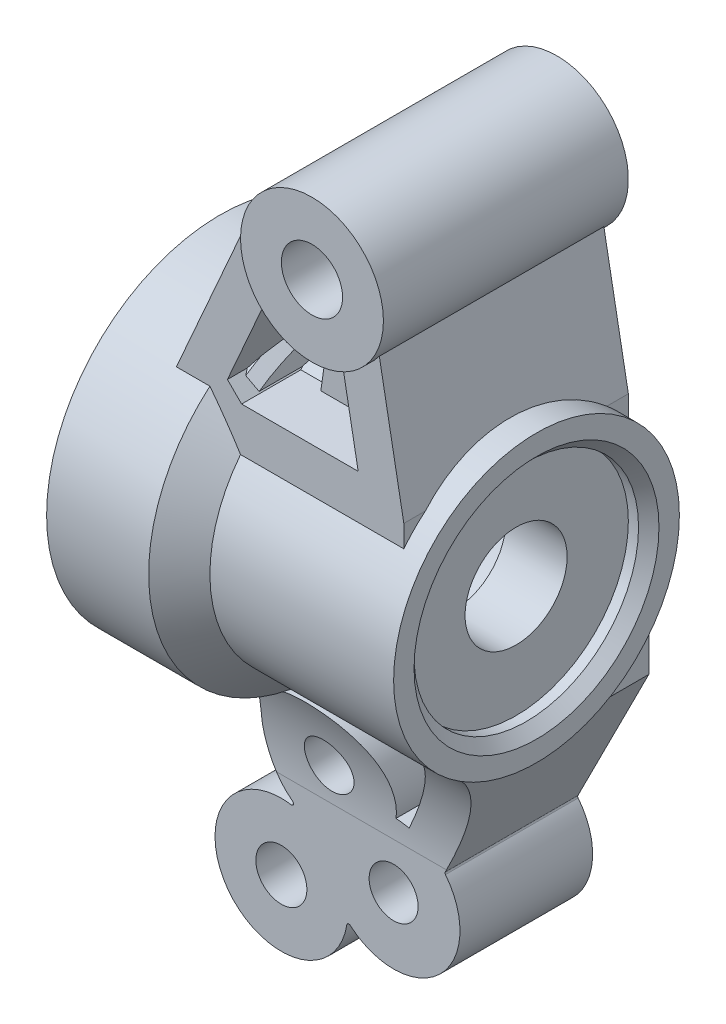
ISO-10303-21;
HEADER;
FILE_DESCRIPTION(('STEP AP214'),'2;1');
FILE_NAME('part.step','',(''),(''),'','','');
FILE_SCHEMA(('AUTOMOTIVE_DESIGN { 1 0 10303 214 1 1 1 1 }'));
ENDSEC;
DATA;
#1=APPLICATION_CONTEXT('core data for automotive mechanical design processes');
#2=APPLICATION_PROTOCOL_DEFINITION('international standard','automotive_design',2000,#1);
#3=PRODUCT_CONTEXT('',#1,'mechanical');
#4=PRODUCT('Part','Part','',(#3));
#5=PRODUCT_RELATED_PRODUCT_CATEGORY('part','',(#4));
#6=PRODUCT_DEFINITION_FORMATION('','',#4);
#7=PRODUCT_DEFINITION_CONTEXT('part definition',#1,'design');
#8=PRODUCT_DEFINITION('design','',#6,#7);
#9=PRODUCT_DEFINITION_SHAPE('','',#8);
#10=(LENGTH_UNIT() NAMED_UNIT(*) SI_UNIT(.MILLI.,.METRE.));
#11=(NAMED_UNIT(*) PLANE_ANGLE_UNIT() SI_UNIT($,.RADIAN.));
#12=(NAMED_UNIT(*) SI_UNIT($,.STERADIAN.) SOLID_ANGLE_UNIT());
#13=UNCERTAINTY_MEASURE_WITH_UNIT(LENGTH_MEASURE(1.E-05),#10,'distance_accuracy_value','');
#14=(GEOMETRIC_REPRESENTATION_CONTEXT(3) GLOBAL_UNCERTAINTY_ASSIGNED_CONTEXT((#13)) GLOBAL_UNIT_ASSIGNED_CONTEXT((#10,
#11,#12)) REPRESENTATION_CONTEXT('',''));
#15=CARTESIAN_POINT('',(0.,0.,0.));
#16=DIRECTION('',(0.,0.,1.));
#17=DIRECTION('',(1.,0.,0.));
#18=AXIS2_PLACEMENT_3D('',#15,#16,#17);
#19=CARTESIAN_POINT('',(-9.,0.,0.));
#20=DIRECTION('',(1.,0.,0.));
#21=DIRECTION('',(0.,0.,-1.));
#22=AXIS2_PLACEMENT_3D('',#19,#20,#21);
#23=CYLINDRICAL_SURFACE('',#22,7.);
#24=CARTESIAN_POINT('',(-9.,0.,0.));
#25=DIRECTION('',(1.,0.,0.));
#26=DIRECTION('',(0.,0.,-1.));
#27=AXIS2_PLACEMENT_3D('',#24,#25,#26);
#28=CIRCLE('',#27,7.);
#29=CARTESIAN_POINT('',(-9.,6.55271087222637,-2.46210889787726));
#30=VERTEX_POINT('',#29);
#31=CARTESIAN_POINT('',(-9.,6.92820323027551,-1.));
#32=VERTEX_POINT('',#31);
#33=EDGE_CURVE('E966',#30,#32,#28,.T.);
#34=ORIENTED_EDGE('',*,*,#33,.T.);
#35=DIRECTION('',(1.,0.,0.));
#36=VECTOR('',#35,1.);
#37=CARTESIAN_POINT('',(-9.,6.92820323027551,-1.));
#38=LINE('',#37,#36);
#39=CARTESIAN_POINT('',(-7.50549061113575,6.92820323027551,-1.));
#40=VERTEX_POINT('',#39);
#41=EDGE_CURVE('E1282',#32,#40,#38,.T.);
#42=ORIENTED_EDGE('',*,*,#41,.T.);
#43=CARTESIAN_POINT('',(-8.50189581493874,0.,0.));
#44=DIRECTION('',(0.989815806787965,-0.14235402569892,0.));
#45=DIRECTION('',(0.14235402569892,0.989815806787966,0.));
#46=AXIS2_PLACEMENT_3D('',#43,#44,#45);
#47=ELLIPSE('',#46,7.07202284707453,7.);
#48=CARTESIAN_POINT('',(-7.56707424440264,6.5,-2.59807621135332));
#49=VERTEX_POINT('',#48);
#50=EDGE_CURVE('E1249',#40,#49,#47,.F.);
#51=ORIENTED_EDGE('',*,*,#50,.T.);
#52=DIRECTION('',(1.,0.,0.));
#53=VECTOR('',#52,1.);
#54=CARTESIAN_POINT('',(-9.,6.5,-2.59807621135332));
#55=LINE('',#54,#53);
#56=CARTESIAN_POINT('',(-8.94728912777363,6.5,-2.59807621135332));
#57=VERTEX_POINT('',#56);
#58=EDGE_CURVE('E960',#49,#57,#55,.F.);
#59=ORIENTED_EDGE('',*,*,#58,.T.);
#60=CARTESIAN_POINT('',(-2.44728912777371,0.,0.));
#61=DIRECTION('',(0.707106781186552,0.707106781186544,0.));
#62=DIRECTION('',(0.707106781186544,-0.707106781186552,0.));
#63=AXIS2_PLACEMENT_3D('',#60,#61,#62);
#64=ELLIPSE('',#63,9.89949493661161,7.);
#65=EDGE_CURVE('E819',#30,#57,#64,.F.);
#66=ORIENTED_EDGE('',*,*,#65,.F.);
#67=EDGE_LOOP('',(#34,#42,#51,#59,#66));
#68=FACE_BOUND('',#67,.T.);
#69=ADVANCED_FACE('F350',(#68),#23,.T.);
#70=CARTESIAN_POINT('',(-9.94728912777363,6.5,5.5));
#71=DIRECTION('',(0.914960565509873,-0.40354326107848,0.));
#72=DIRECTION('',(0.40354326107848,0.914960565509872,0.));
#73=AXIS2_PLACEMENT_3D('',#70,#71,#72);
#74=PLANE('',#73);
#75=DIRECTION('',(0.,0.,-1.));
#76=VECTOR('',#75,1.);
#77=CARTESIAN_POINT('',(-7.64855668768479,11.7119555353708,5.5));
#78=LINE('',#77,#76);
#79=CARTESIAN_POINT('',(-7.64855668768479,11.7119555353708,-1.));
#80=VERTEX_POINT('',#79);
#81=CARTESIAN_POINT('',(-7.64855668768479,11.7119555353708,-5.5));
#82=VERTEX_POINT('',#81);
#83=EDGE_CURVE('E354',#80,#82,#78,.T.);
#84=ORIENTED_EDGE('',*,*,#83,.F.);
#85=DIRECTION('',(-0.40354326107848,-0.914960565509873,0.));
#86=VECTOR('',#85,1.);
#87=CARTESIAN_POINT('',(-7.64855668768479,11.7119555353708,-1.));
#88=LINE('',#87,#86);
#89=CARTESIAN_POINT('',(-9.21696138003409,8.15588464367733,-1.));
#90=VERTEX_POINT('',#89);
#91=EDGE_CURVE('E754',#80,#90,#88,.T.);
#92=ORIENTED_EDGE('',*,*,#91,.T.);
#93=CARTESIAN_POINT('',(-15.6672629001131,-6.46899475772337,0.));
#94=DIRECTION('',(0.914960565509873,-0.40354326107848,0.));
#95=DIRECTION('',(-0.40354326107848,-0.914960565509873,0.));
#96=AXIS2_PLACEMENT_3D('',#93,#94,#95);
#97=ELLIPSE('',#96,16.0304863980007,13.1636130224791);
#98=CARTESIAN_POINT('',(-9.50000000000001,7.51414632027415,-3.97336193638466));
#99=VERTEX_POINT('',#98);
#100=EDGE_CURVE('E1315',#90,#99,#97,.F.);
#101=ORIENTED_EDGE('',*,*,#100,.T.);
#102=CARTESIAN_POINT('',(-12.8141134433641,0.,0.));
#103=DIRECTION('',(0.914960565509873,-0.40354326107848,0.));
#104=DIRECTION('',(0.40354326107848,0.914960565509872,0.));
#105=AXIS2_PLACEMENT_3D('',#102,#103,#104);
#106=ELLIPSE('',#105,9.29001786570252,8.5);
#107=CARTESIAN_POINT('',(-9.6412276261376,7.19393849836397,-4.5273887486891));
#108=VERTEX_POINT('',#107);
#109=EDGE_CURVE('E987',#99,#108,#106,.F.);
#110=ORIENTED_EDGE('',*,*,#109,.T.);
#111=DIRECTION('',(0.,0.,-1.));
#112=VECTOR('',#111,1.);
#113=CARTESIAN_POINT('',(-9.6412276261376,7.19393849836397,-5.5));
#114=LINE('',#113,#112);
#115=CARTESIAN_POINT('',(-9.6412276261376,7.19393849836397,-5.5));
#116=VERTEX_POINT('',#115);
#117=EDGE_CURVE('E811',#108,#116,#114,.T.);
#118=ORIENTED_EDGE('',*,*,#117,.T.);
#119=DIRECTION('',(-0.40354326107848,-0.914960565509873,0.));
#120=VECTOR('',#119,1.);
#121=CARTESIAN_POINT('',(-9.94728912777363,6.5,-5.5));
#122=LINE('',#121,#120);
#123=EDGE_CURVE('E827',#82,#116,#122,.T.);
#124=ORIENTED_EDGE('',*,*,#123,.F.);
#125=EDGE_LOOP('',(#84,#92,#101,#110,#118,#124));
#126=FACE_BOUND('',#125,.T.);
#127=ADVANCED_FACE('F1353',(#126),#74,.T.);
#128=CARTESIAN_POINT('',(-3.23557189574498,6.5,5.5));
#129=DIRECTION('',(-0.983336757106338,-0.181793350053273,0.));
#130=DIRECTION('',(0.181793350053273,-0.983336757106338,0.));
#131=AXIS2_PLACEMENT_3D('',#128,#129,#130);
#132=PLANE('',#131);
#133=CARTESIAN_POINT('',(-2.03389122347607,0.,0.));
#134=DIRECTION('',(-0.983336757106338,-0.181793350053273,0.));
#135=DIRECTION('',(0.181793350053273,-0.983336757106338,0.));
#136=AXIS2_PLACEMENT_3D('',#133,#134,#135);
#137=ELLIPSE('',#136,7.11861928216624,7.);
#138=CARTESIAN_POINT('',(-3.31473551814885,6.92820323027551,-1.));
#139=VERTEX_POINT('',#138);
#140=CARTESIAN_POINT('',(-3.23557189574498,6.5,-2.59807621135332));
#141=VERTEX_POINT('',#140);
#142=EDGE_CURVE('E763',#139,#141,#137,.T.);
#143=ORIENTED_EDGE('',*,*,#142,.F.);
#144=DIRECTION('',(-0.181793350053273,0.983336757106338,0.));
#145=VECTOR('',#144,1.);
#146=CARTESIAN_POINT('',(-3.23557189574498,6.5,-1.));
#147=LINE('',#146,#145);
#148=CARTESIAN_POINT('',(-4.00193395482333,10.6453220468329,-1.));
#149=VERTEX_POINT('',#148);
#150=EDGE_CURVE('E749',#139,#149,#147,.T.);
#151=ORIENTED_EDGE('',*,*,#150,.T.);
#152=DIRECTION('',(0.,0.,-1.));
#153=VECTOR('',#152,1.);
#154=CARTESIAN_POINT('',(-4.00193395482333,10.6453220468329,5.5));
#155=LINE('',#154,#153);
#156=CARTESIAN_POINT('',(-4.00193395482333,10.6453220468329,-5.5));
#157=VERTEX_POINT('',#156);
#158=EDGE_CURVE('E760',#149,#157,#155,.T.);
#159=ORIENTED_EDGE('',*,*,#158,.T.);
#160=DIRECTION('',(-0.181793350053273,0.983336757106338,0.));
#161=VECTOR('',#160,1.);
#162=CARTESIAN_POINT('',(-3.23557189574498,6.5,-5.5));
#163=LINE('',#162,#161);
#164=CARTESIAN_POINT('',(-3.23557189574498,6.5,-5.5));
#165=VERTEX_POINT('',#164);
#166=EDGE_CURVE('E1494',#165,#157,#163,.T.);
#167=ORIENTED_EDGE('',*,*,#166,.F.);
#168=DIRECTION('',(0.,0.,-1.));
#169=VECTOR('',#168,1.);
#170=CARTESIAN_POINT('',(-3.23557189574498,6.5,5.5));
#171=LINE('',#170,#169);
#172=EDGE_CURVE('E773',#141,#165,#171,.T.);
#173=ORIENTED_EDGE('',*,*,#172,.F.);
#174=EDGE_LOOP('',(#143,#151,#159,#167,#173));
#175=FACE_BOUND('',#174,.T.);
#176=ADVANCED_FACE('F758',(#175),#132,.T.);
#177=CARTESIAN_POINT('',(-6.48131785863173,0.,0.));
#178=DIRECTION('',(0.989815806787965,-0.14235402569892,0.));
#179=DIRECTION('',(0.14235402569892,0.989815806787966,0.));
#180=AXIS2_PLACEMENT_3D('',#177,#178,#179);
#181=ELLIPSE('',#180,7.07202284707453,7.);
#182=CARTESIAN_POINT('',(-5.48491265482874,6.92820323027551,-1.));
#183=VERTEX_POINT('',#182);
#184=CARTESIAN_POINT('',(-5.54649628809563,6.5,-2.59807621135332));
#185=VERTEX_POINT('',#184);
#186=EDGE_CURVE('E1250',#183,#185,#181,.F.);
#187=ORIENTED_EDGE('',*,*,#186,.F.);
#188=DIRECTION('',(1.,0.,0.));
#189=VECTOR('',#188,1.);
#190=CARTESIAN_POINT('',(-9.,6.92820323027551,-1.));
#191=LINE('',#190,#189);
#192=EDGE_CURVE('E1277',#183,#139,#191,.T.);
#193=ORIENTED_EDGE('',*,*,#192,.T.);
#194=ORIENTED_EDGE('',*,*,#142,.T.);
#195=EDGE_CURVE('E957',#141,#185,#55,.F.);
#196=ORIENTED_EDGE('',*,*,#195,.T.);
#197=EDGE_LOOP('',(#187,#193,#194,#196));
#198=FACE_BOUND('',#197,.T.);
#199=ADVANCED_FACE('F1355',(#198),#23,.T.);
#200=CARTESIAN_POINT('',(-9.,0.,0.));
#201=DIRECTION('',(-1.,0.,0.));
#202=DIRECTION('',(0.,0.,1.));
#203=AXIS2_PLACEMENT_3D('',#200,#201,#202);
#204=PLANE('',#203);
#205=DIRECTION('',(0.,1.,0.));
#206=VECTOR('',#205,1.);
#207=CARTESIAN_POINT('',(-9.,0.,-1.));
#208=LINE('',#207,#206);
#209=CARTESIAN_POINT('',(-9.,7.93725393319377,-1.));
#210=VERTEX_POINT('',#209);
#211=EDGE_CURVE('E1285',#32,#210,#208,.T.);
#212=ORIENTED_EDGE('',*,*,#211,.F.);
#213=ORIENTED_EDGE('',*,*,#33,.F.);
#214=DIRECTION('',(0.,0.,1.));
#215=VECTOR('',#214,1.);
#216=CARTESIAN_POINT('',(-9.,6.55271087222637,5.5));
#217=LINE('',#216,#215);
#218=CARTESIAN_POINT('',(-9.,6.55271087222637,-4.58933330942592));
#219=VERTEX_POINT('',#218);
#220=EDGE_CURVE('E988',#30,#219,#217,.F.);
#221=ORIENTED_EDGE('',*,*,#220,.T.);
#222=CARTESIAN_POINT('',(-9.,0.,0.));
#223=DIRECTION('',(-1.,0.,0.));
#224=DIRECTION('',(0.,0.,1.));
#225=AXIS2_PLACEMENT_3D('',#222,#223,#224);
#226=CIRCLE('',#225,8.);
#227=EDGE_CURVE('E1311',#219,#210,#226,.F.);
#228=ORIENTED_EDGE('',*,*,#227,.T.);
#229=EDGE_LOOP('',(#212,#213,#221,#228));
#230=FACE_BOUND('',#229,.T.);
#231=ADVANCED_FACE('F1363',(#230),#204,.F.);
#232=CARTESIAN_POINT('',(-9.50000000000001,0.,0.));
#233=DIRECTION('',(-1.,0.,0.));
#234=DIRECTION('',(0.,0.,1.));
#235=AXIS2_PLACEMENT_3D('',#232,#233,#234);
#236=CONICAL_SURFACE('',#235,8.5,0.785398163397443);
#237=ORIENTED_EDGE('',*,*,#100,.F.);
#238=CARTESIAN_POINT('',(-11.4924983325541,10.4447365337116,-1.));
#239=CARTESIAN_POINT('',(-11.1021142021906,10.0525484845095,-1.));
#240=CARTESIAN_POINT('',(-10.7118125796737,9.66027816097,-1.));
#241=CARTESIAN_POINT('',(-9.93150138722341,8.87544830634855,-1.));
#242=CARTESIAN_POINT('',(-9.54149181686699,8.48288877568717,-1.));
#243=CARTESIAN_POINT('',(-8.76189019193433,7.69735426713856,-1.));
#244=CARTESIAN_POINT('',(-8.37229813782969,7.30437928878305,-1.));
#245=CARTESIAN_POINT('',(-7.78841570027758,6.71441573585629,-1.));
#246=CARTESIAN_POINT('',(-7.59387235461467,6.51767756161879,-1.));
#247=CARTESIAN_POINT('',(-7.20501203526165,6.12397745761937,-1.));
#248=CARTESIAN_POINT('',(-7.01069506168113,5.92701552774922,-1.));
#249=CARTESIAN_POINT('',(-6.81652023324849,5.72991340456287,-1.));
#250=B_SPLINE_CURVE_WITH_KNOTS('',3,(#238,#239,#240,#241,#242,#243,#244,#245,#246,#247,#248,
#249),.UNSPECIFIED.,.F.,.F.,(4,2,2,2,2,4),(0.,1.66009082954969,3.32017924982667,
4.98026954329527,5.8103158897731,6.64036263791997),.UNSPECIFIED.);
#251=EDGE_CURVE('E1288',#90,#210,#250,.T.);
#252=ORIENTED_EDGE('',*,*,#251,.T.);
#253=ORIENTED_EDGE('',*,*,#227,.F.);
#254=CARTESIAN_POINT('',(-9.50000000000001,7.05271087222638,-4.74439346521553));
#255=CARTESIAN_POINT('',(-9.41660316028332,6.96931403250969,-4.71895971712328));
#256=CARTESIAN_POINT('',(-9.33323807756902,6.88594894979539,-4.69332116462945));
#257=CARTESIAN_POINT('',(-9.16657141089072,6.71928228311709,-4.6416344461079));
#258=CARTESIAN_POINT('',(-9.08326982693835,6.63598069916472,-4.61558628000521));
#259=CARTESIAN_POINT('',(-9.,6.55271087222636,-4.58933330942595));
#260=B_SPLINE_CURVE_WITH_KNOTS('',3,(#254,#255,#256,#257,#258,#259),.UNSPECIFIED.,.F.,.F.,(4,2,
4),(0.,0.361954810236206,0.72390968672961),.UNSPECIFIED.);
#261=CARTESIAN_POINT('',(-9.50000000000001,7.05271087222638,-4.74439346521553));
#262=VERTEX_POINT('',#261);
#263=EDGE_CURVE('E1323',#262,#219,#260,.T.);
#264=ORIENTED_EDGE('',*,*,#263,.F.);
#265=CARTESIAN_POINT('',(-9.50000000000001,0.,0.));
#266=DIRECTION('',(-1.,0.,0.));
#267=DIRECTION('',(0.,0.,1.));
#268=AXIS2_PLACEMENT_3D('',#265,#266,#267);
#269=CIRCLE('',#268,8.5);
#270=EDGE_CURVE('E1317',#99,#262,#269,.T.);
#271=ORIENTED_EDGE('',*,*,#270,.F.);
#272=EDGE_LOOP('',(#237,#252,#253,#264,#271));
#273=FACE_BOUND('',#272,.T.);
#274=ADVANCED_FACE('F1725',(#273),#236,.T.);
#275=CARTESIAN_POINT('',(-6.79702438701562,11.8543095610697,3.));
#276=DIRECTION('',(0.989815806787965,-0.14235402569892,0.));
#277=DIRECTION('',(0.14235402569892,0.989815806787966,0.));
#278=AXIS2_PLACEMENT_3D('',#275,#276,#277);
#279=PLANE('',#278);
#280=DIRECTION('',(-0.14235402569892,-0.989815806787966,0.));
#281=VECTOR('',#280,1.);
#282=CARTESIAN_POINT('',(-6.79702438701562,11.8543095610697,-1.));
#283=LINE('',#282,#281);
#284=CARTESIAN_POINT('',(-6.91021924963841,11.0672432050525,-1.));
#285=VERTEX_POINT('',#284);
#286=EDGE_CURVE('E1279',#285,#40,#283,.T.);
#287=ORIENTED_EDGE('',*,*,#286,.F.);
#288=DIRECTION('',(0.,0.,-1.));
#289=VECTOR('',#288,1.);
#290=CARTESIAN_POINT('',(-6.91021924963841,11.0672432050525,5.5));
#291=LINE('',#290,#289);
#292=CARTESIAN_POINT('',(-6.91021924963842,11.0672432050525,-3.));
#293=VERTEX_POINT('',#292);
#294=EDGE_CURVE('E1009',#285,#293,#291,.T.);
#295=ORIENTED_EDGE('',*,*,#294,.T.);
#296=DIRECTION('',(-0.14235402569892,-0.989815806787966,0.));
#297=VECTOR('',#296,1.);
#298=CARTESIAN_POINT('',(-6.79702438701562,11.8543095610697,-3.));
#299=LINE('',#298,#297);
#300=CARTESIAN_POINT('',(-7.56707424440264,6.5,-3.));
#301=VERTEX_POINT('',#300);
#302=EDGE_CURVE('E1032',#293,#301,#299,.T.);
#303=ORIENTED_EDGE('',*,*,#302,.T.);
#304=DIRECTION('',(0.,0.,-1.));
#305=VECTOR('',#304,1.);
#306=CARTESIAN_POINT('',(-7.56707424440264,6.5,5.5));
#307=LINE('',#306,#305);
#308=EDGE_CURVE('E1012',#49,#301,#307,.T.);
#309=ORIENTED_EDGE('',*,*,#308,.F.);
#310=ORIENTED_EDGE('',*,*,#50,.F.);
#311=EDGE_LOOP('',(#287,#295,#303,#309,#310));
#312=FACE_BOUND('',#311,.T.);
#313=ADVANCED_FACE('F1717',(#312),#279,.F.);
#314=CARTESIAN_POINT('',(-4.81739277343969,11.5696015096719,3.));
#315=DIRECTION('',(0.989815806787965,-0.14235402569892,0.));
#316=DIRECTION('',(0.14235402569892,0.989815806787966,0.));
#317=AXIS2_PLACEMENT_3D('',#314,#315,#316);
#318=PLANE('',#317);
#319=DIRECTION('',(0.,0.,-1.));
#320=VECTOR('',#319,1.);
#321=CARTESIAN_POINT('',(-4.97120443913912,10.5001184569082,5.5));
#322=LINE('',#321,#320);
#323=CARTESIAN_POINT('',(-4.97120443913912,10.5001184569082,-1.));
#324=VERTEX_POINT('',#323);
#325=CARTESIAN_POINT('',(-4.97120443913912,10.5001184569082,-3.));
#326=VERTEX_POINT('',#325);
#327=EDGE_CURVE('E1016',#324,#326,#322,.T.);
#328=ORIENTED_EDGE('',*,*,#327,.F.);
#329=DIRECTION('',(-0.14235402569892,-0.989815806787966,0.));
#330=VECTOR('',#329,1.);
#331=CARTESIAN_POINT('',(-4.81739277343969,11.5696015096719,-1.));
#332=LINE('',#331,#330);
#333=EDGE_CURVE('E360',#324,#183,#332,.T.);
#334=ORIENTED_EDGE('',*,*,#333,.T.);
#335=ORIENTED_EDGE('',*,*,#186,.T.);
#336=DIRECTION('',(0.,0.,-1.));
#337=VECTOR('',#336,1.);
#338=CARTESIAN_POINT('',(-5.54649628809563,6.5,5.5));
#339=LINE('',#338,#337);
#340=CARTESIAN_POINT('',(-5.54649628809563,6.5,-3.));
#341=VERTEX_POINT('',#340);
#342=EDGE_CURVE('E1020',#185,#341,#339,.T.);
#343=ORIENTED_EDGE('',*,*,#342,.T.);
#344=DIRECTION('',(-0.14235402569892,-0.989815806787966,0.));
#345=VECTOR('',#344,1.);
#346=CARTESIAN_POINT('',(-4.81739277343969,11.5696015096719,-3.));
#347=LINE('',#346,#345);
#348=EDGE_CURVE('E1029',#326,#341,#347,.T.);
#349=ORIENTED_EDGE('',*,*,#348,.F.);
#350=EDGE_LOOP('',(#328,#334,#335,#343,#349));
#351=FACE_BOUND('',#350,.T.);
#352=ADVANCED_FACE('F1709',(#351),#318,.T.);
#353=CARTESIAN_POINT('',(-9.24104145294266,-7.,-6.5));
#354=DIRECTION('',(-0.661049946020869,0.750341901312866,0.));
#355=DIRECTION('',(-0.750341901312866,-0.661049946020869,0.));
#356=AXIS2_PLACEMENT_3D('',#353,#354,#355);
#357=PLANE('',#356);
#358=DIRECTION('',(0.750341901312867,0.661049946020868,0.));
#359=VECTOR('',#358,1.);
#360=CARTESIAN_POINT('',(-11.2928909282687,-8.80767591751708,-1.5));
#361=LINE('',#360,#359);
#362=CARTESIAN_POINT('',(-11.2928909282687,-8.80767591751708,-1.5));
#363=VERTEX_POINT('',#362);
#364=CARTESIAN_POINT('',(-10.792236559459,-8.36660026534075,-1.5));
#365=VERTEX_POINT('',#364);
#366=EDGE_CURVE('E1045',#363,#365,#361,.T.);
#367=ORIENTED_EDGE('',*,*,#366,.T.);
#368=CARTESIAN_POINT('',(-1.29550974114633,0.,0.));
#369=DIRECTION('',(-0.661049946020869,0.750341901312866,0.));
#370=DIRECTION('',(0.750341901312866,0.661049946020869,0.));
#371=AXIS2_PLACEMENT_3D('',#368,#369,#370);
#372=ELLIPSE('',#371,12.8583324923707,8.5);
#373=CARTESIAN_POINT('',(-10.7753368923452,-8.35171168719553,1.58079470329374));
#374=VERTEX_POINT('',#373);
#375=EDGE_CURVE('E983',#374,#365,#372,.F.);
#376=ORIENTED_EDGE('',*,*,#375,.F.);
#377=CARTESIAN_POINT('',(-16.9002242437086,-13.7477270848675,10.));
#378=DIRECTION('',(-0.661049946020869,0.750341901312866,0.));
#379=DIRECTION('',(0.750341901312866,0.661049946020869,0.));
#380=AXIS2_PLACEMENT_3D('',#377,#378,#379);
#381=ELLIPSE('',#380,15.1274499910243,10.);
#382=CARTESIAN_POINT('',(-11.2928909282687,-8.80767591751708,1.30541004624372));
#383=VERTEX_POINT('',#382);
#384=EDGE_CURVE('E1214',#374,#383,#381,.T.);
#385=ORIENTED_EDGE('',*,*,#384,.T.);
#386=DIRECTION('',(0.,0.,1.));
#387=VECTOR('',#386,1.);
#388=CARTESIAN_POINT('',(-11.2928909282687,-8.80767591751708,-6.5));
#389=LINE('',#388,#387);
#390=EDGE_CURVE('E1417',#363,#383,#389,.T.);
#391=ORIENTED_EDGE('',*,*,#390,.F.);
#392=EDGE_LOOP('',(#367,#376,#385,#391));
#393=FACE_BOUND('',#392,.T.);
#394=ADVANCED_FACE('F1590',(#393),#357,.F.);
#395=CARTESIAN_POINT('',(-3.24104145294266,-7.,-6.5));
#396=DIRECTION('',(0.,1.,0.));
#397=DIRECTION('',(-1.,0.,0.));
#398=AXIS2_PLACEMENT_3D('',#395,#396,#397);
#399=PLANE('',#398);
#400=DIRECTION('',(1.,0.,0.));
#401=VECTOR('',#400,1.);
#402=CARTESIAN_POINT('',(-3.24104145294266,-7.,-1.5));
#403=LINE('',#402,#401);
#404=CARTESIAN_POINT('',(-9.15891053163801,-7.,-1.50000000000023));
#405=VERTEX_POINT('',#404);
#406=CARTESIAN_POINT('',(-3.24104145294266,-7.,-1.5));
#407=VERTEX_POINT('',#406);
#408=EDGE_CURVE('E1042',#405,#407,#403,.T.);
#409=ORIENTED_EDGE('',*,*,#408,.T.);
#410=DIRECTION('',(0.,0.,1.));
#411=VECTOR('',#410,1.);
#412=CARTESIAN_POINT('',(-3.24104145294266,-7.,-6.5));
#413=LINE('',#412,#411);
#414=CARTESIAN_POINT('',(-3.24104145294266,-7.,0.));
#415=VERTEX_POINT('',#414);
#416=EDGE_CURVE('E1424',#407,#415,#413,.T.);
#417=ORIENTED_EDGE('',*,*,#416,.T.);
#418=DIRECTION('',(-1.,0.,0.));
#419=VECTOR('',#418,1.);
#420=CARTESIAN_POINT('',(-3.24104145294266,-7.,0.));
#421=LINE('',#420,#419);
#422=CARTESIAN_POINT('',(-9.,-7.,0.));
#423=VERTEX_POINT('',#422);
#424=EDGE_CURVE('E922',#415,#423,#421,.T.);
#425=ORIENTED_EDGE('',*,*,#424,.T.);
#426=CARTESIAN_POINT('',(-9.,-6.99999999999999,0.));
#427=CARTESIAN_POINT('',(-8.99994742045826,-7.,-0.156452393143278));
#428=CARTESIAN_POINT('',(-9.0052445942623,-7.,-0.312884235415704));
#429=CARTESIAN_POINT('',(-9.02609826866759,-7.00000000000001,-0.624444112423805));
#430=CARTESIAN_POINT('',(-9.04161406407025,-7.,-0.779574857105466));
#431=CARTESIAN_POINT('',(-9.08246604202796,-7.,-1.08848264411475));
#432=CARTESIAN_POINT('',(-9.10779991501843,-7.,-1.24225999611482));
#433=CARTESIAN_POINT('',(-9.16767538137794,-7.,-1.54865312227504));
#434=CARTESIAN_POINT('',(-9.20225318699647,-7.,-1.70126184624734));
#435=CARTESIAN_POINT('',(-9.24104145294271,-7.,-1.85274966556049));
#436=B_SPLINE_CURVE_WITH_KNOTS('',3,(#426,#427,#428,#429,#430,#431,#432,#433,#434,#435),
.UNSPECIFIED.,.F.,.F.,(4,2,2,2,4),(0.,0.469235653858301,0.936613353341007,1.4038811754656,
1.87300700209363),.UNSPECIFIED.);
#437=EDGE_CURVE('E1132',#423,#405,#436,.T.);
#438=ORIENTED_EDGE('',*,*,#437,.T.);
#439=EDGE_LOOP('',(#409,#417,#425,#438));
#440=FACE_BOUND('',#439,.T.);
#441=ADVANCED_FACE('F1148',(#440),#399,.F.);
#442=CARTESIAN_POINT('',(-7.,-16.,-6.5));
#443=DIRECTION('',(0.,0.,1.));
#444=DIRECTION('',(1.,0.,0.));
#445=AXIS2_PLACEMENT_3D('',#442,#443,#444);
#446=CYLINDRICAL_SURFACE('',#445,3.25);
#447=CARTESIAN_POINT('',(-7.,-16.,-1.5));
#448=DIRECTION('',(0.,0.,-1.));
#449=DIRECTION('',(-1.,0.,0.));
#450=AXIS2_PLACEMENT_3D('',#447,#448,#449);
#451=CIRCLE('',#450,3.25);
#452=CARTESIAN_POINT('',(-6.83867522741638,-12.7540064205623,-1.5));
#453=VERTEX_POINT('',#452);
#454=CARTESIAN_POINT('',(-6.19860643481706,-12.8503542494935,-1.5));
#455=VERTEX_POINT('',#454);
#456=EDGE_CURVE('E1038',#453,#455,#451,.T.);
#457=ORIENTED_EDGE('',*,*,#456,.F.);
#458=DIRECTION('',(0.,0.,1.));
#459=VECTOR('',#458,1.);
#460=CARTESIAN_POINT('',(-6.83867522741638,-12.7540064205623,-6.5));
#461=LINE('',#460,#459);
#462=CARTESIAN_POINT('',(-6.83867522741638,-12.7540064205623,0.0494965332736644));
#463=VERTEX_POINT('',#462);
#464=EDGE_CURVE('E1409',#453,#463,#461,.T.);
#465=ORIENTED_EDGE('',*,*,#464,.T.);
#466=CARTESIAN_POINT('',(-6.83867522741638,-12.7540064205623,0.0494965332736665));
#467=CARTESIAN_POINT('',(-6.78463916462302,-12.7566908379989,0.0492295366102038));
#468=CARTESIAN_POINT('',(-6.73067114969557,-12.7607268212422,0.0488264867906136));
#469=CARTESIAN_POINT('',(-6.62314074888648,-12.77147285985,0.0477659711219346));
#470=CARTESIAN_POINT('',(-6.56957768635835,-12.778176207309,0.0471091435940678));
#471=CARTESIAN_POINT('',(-6.46285535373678,-12.7942414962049,0.0455572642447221));
#472=CARTESIAN_POINT('',(-6.40969608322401,-12.8036034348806,0.0446622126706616));
#473=CARTESIAN_POINT('',(-6.30378060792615,-12.8249871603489,0.0426578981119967));
#474=CARTESIAN_POINT('',(-6.25102574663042,-12.8370155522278,0.0415481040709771));
#475=CARTESIAN_POINT('',(-6.19860643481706,-12.8503542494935,0.0403452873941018));
#476=B_SPLINE_CURVE_WITH_KNOTS('',3,(#466,#467,#468,#469,#470,#471,#472,#473,#474,#475),
.UNSPECIFIED.,.F.,.F.,(4,2,2,2,4),(0.,0.162292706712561,0.324179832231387,0.486066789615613,
0.648359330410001),.UNSPECIFIED.);
#477=CARTESIAN_POINT('',(-6.19860643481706,-12.8503542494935,0.0403452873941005));
#478=VERTEX_POINT('',#477);
#479=EDGE_CURVE('E1168',#463,#478,#476,.T.);
#480=ORIENTED_EDGE('',*,*,#479,.T.);
#481=DIRECTION('',(0.,0.,1.));
#482=VECTOR('',#481,1.);
#483=CARTESIAN_POINT('',(-6.19860643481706,-12.8503542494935,-6.5));
#484=LINE('',#483,#482);
#485=EDGE_CURVE('E1404',#455,#478,#484,.T.);
#486=ORIENTED_EDGE('',*,*,#485,.F.);
#487=EDGE_LOOP('',(#457,#465,#480,#486));
#488=FACE_BOUND('',#487,.T.);
#489=ADVANCED_FACE('F1164',(#488),#446,.T.);
#490=CARTESIAN_POINT('',(-10.,-12.,-6.5));
#491=DIRECTION('',(0.,0.,1.));
#492=DIRECTION('',(1.,0.,0.));
#493=AXIS2_PLACEMENT_3D('',#490,#491,#492);
#494=CYLINDRICAL_SURFACE('',#493,3.25);
#495=CARTESIAN_POINT('',(-10.,-12.,-1.5));
#496=DIRECTION('',(0.,0.,1.));
#497=DIRECTION('',(-1.,0.,0.));
#498=AXIS2_PLACEMENT_3D('',#495,#496,#497);
#499=CIRCLE('',#498,3.25);
#500=CARTESIAN_POINT('',(-11.1901654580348,-8.97576353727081,-1.5));
#501=VERTEX_POINT('',#500);
#502=EDGE_CURVE('E1051',#453,#501,#499,.T.);
#503=ORIENTED_EDGE('',*,*,#502,.T.);
#504=DIRECTION('',(0.,0.,1.));
#505=VECTOR('',#504,1.);
#506=CARTESIAN_POINT('',(-11.1901654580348,-8.97576353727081,-6.5));
#507=LINE('',#506,#505);
#508=CARTESIAN_POINT('',(-11.1901654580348,-8.97576353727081,1.21203300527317));
#509=VERTEX_POINT('',#508);
#510=EDGE_CURVE('E1413',#501,#509,#507,.T.);
#511=ORIENTED_EDGE('',*,*,#510,.T.);
#512=CARTESIAN_POINT('',(-11.1901654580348,-8.97576353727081,1.21203300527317));
#513=CARTESIAN_POINT('',(-11.1160090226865,-8.94657020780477,1.22788998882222));
#514=CARTESIAN_POINT('',(-11.0405252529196,-8.92002389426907,1.24248900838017));
#515=CARTESIAN_POINT('',(-10.887330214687,-8.87245056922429,1.26888083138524));
#516=CARTESIAN_POINT('',(-10.8096181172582,-8.85142564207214,1.28067257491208));
#517=CARTESIAN_POINT('',(-10.6524984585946,-8.81515386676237,1.30114086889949));
#518=CARTESIAN_POINT('',(-10.5730919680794,-8.79990347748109,1.30981932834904));
#519=CARTESIAN_POINT('',(-10.4130865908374,-8.77534346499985,1.32384863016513));
#520=CARTESIAN_POINT('',(-10.3324878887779,-8.76603293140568,1.32919998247));
#521=CARTESIAN_POINT('',(-10.1704577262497,-8.75345430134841,1.33643865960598));
#522=CARTESIAN_POINT('',(-10.0890247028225,-8.75020115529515,1.33831741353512));
#523=CARTESIAN_POINT('',(-9.92613081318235,-8.74981651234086,1.33854057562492));
#524=CARTESIAN_POINT('',(-9.84466994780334,-8.75268727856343,1.33688367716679));
#525=CARTESIAN_POINT('',(-9.60136034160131,-8.77045995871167,1.32664551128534));
#526=CARTESIAN_POINT('',(-9.44027858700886,-8.79449880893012,1.31281023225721));
#527=CARTESIAN_POINT('',(-9.12840017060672,-8.86504949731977,1.27297261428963));
#528=CARTESIAN_POINT('',(-8.97745999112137,-8.91108818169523,1.24722679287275));
#529=CARTESIAN_POINT('',(-8.68543696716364,-9.02360478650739,1.18599076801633));
#530=CARTESIAN_POINT('',(-8.54436165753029,-9.0900981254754,1.15049321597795));
#531=CARTESIAN_POINT('',(-8.26302981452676,-9.24797388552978,1.06911306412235));
#532=CARTESIAN_POINT('',(-8.12388275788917,-9.34100265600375,1.02260063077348));
#533=CARTESIAN_POINT('',(-7.86245483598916,-9.54621785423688,0.92474545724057));
#534=CARTESIAN_POINT('',(-7.74018084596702,-9.658412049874,0.873400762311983));
#535=CARTESIAN_POINT('',(-7.50102631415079,-9.9139172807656,0.762930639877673));
#536=CARTESIAN_POINT('',(-7.38648407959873,-10.0593378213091,0.703601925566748));
#537=CARTESIAN_POINT('',(-7.18334443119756,-10.368094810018,0.586960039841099));
#538=CARTESIAN_POINT('',(-7.09475617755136,-10.5314375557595,0.529647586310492));
#539=CARTESIAN_POINT('',(-6.94371409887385,-10.8781570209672,0.418781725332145));
#540=CARTESIAN_POINT('',(-6.88222953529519,-11.0620199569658,0.365417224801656));
#541=CARTESIAN_POINT('',(-6.79274550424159,-11.4399615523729,0.267981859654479));
#542=CARTESIAN_POINT('',(-6.76470847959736,-11.6340284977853,0.223900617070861));
#543=CARTESIAN_POINT('',(-6.74639769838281,-11.9837987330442,0.155552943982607));
#544=CARTESIAN_POINT('',(-6.74926736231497,-12.1387203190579,0.129062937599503));
#545=CARTESIAN_POINT('',(-6.77024586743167,-12.3704471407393,0.0949893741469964));
#546=CARTESIAN_POINT('',(-6.78003608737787,-12.4476579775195,0.084567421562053));
#547=CARTESIAN_POINT('',(-6.80518273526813,-12.6014285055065,0.0656143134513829));
#548=CARTESIAN_POINT('',(-6.82054100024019,-12.6779879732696,0.057083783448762));
#549=CARTESIAN_POINT('',(-6.83867522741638,-12.7540064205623,0.0494965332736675));
#550=B_SPLINE_CURVE_WITH_KNOTS('',3,(#512,#513,#514,#515,#516,#517,#518,#519,#520,#521,#522,
#523,#524,#525,#526,#527,#528,#529,#530,#531,#532,#533,#534,#535,#536,#537,#538,#539,#540,#541,
#542,#543,#544,#545,#546,#547,#548,#549),.UNSPECIFIED.,.F.,.F.,(4,2,2,2,2,2,2,2,2,2,2,2,2,2,2,2,
2,2,4),(0.,0.243733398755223,0.487558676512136,0.731234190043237,0.974872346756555,
1.2191110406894,1.46344000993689,1.95118873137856,2.42888963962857,2.90695152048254,
3.42604409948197,3.94534757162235,4.5259188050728,5.10669469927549,5.70682403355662,
6.30627886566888,6.77606890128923,7.01144090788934,7.24689063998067),.UNSPECIFIED.);
#551=EDGE_CURVE('E1177',#509,#463,#550,.T.);
#552=ORIENTED_EDGE('',*,*,#551,.T.);
#553=ORIENTED_EDGE('',*,*,#464,.F.);
#554=EDGE_LOOP('',(#503,#511,#552,#553));
#555=FACE_BOUND('',#554,.T.);
#556=ADVANCED_FACE('F1223',(#555),#494,.T.);
#557=CARTESIAN_POINT('',(-11.2267859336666,-8.88271010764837,-6.5));
#558=DIRECTION('',(0.,0.,1.));
#559=DIRECTION('',(1.,0.,0.));
#560=AXIS2_PLACEMENT_3D('',#557,#558,#559);
#561=CYLINDRICAL_SURFACE('',#560,0.0999999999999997);
#562=CARTESIAN_POINT('',(-11.2267859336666,-8.88271010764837,-1.5));
#563=DIRECTION('',(0.,0.,-1.));
#564=DIRECTION('',(-1.,0.,0.));
#565=AXIS2_PLACEMENT_3D('',#562,#563,#564);
#566=CIRCLE('',#565,0.1);
#567=EDGE_CURVE('E1048',#501,#363,#566,.T.);
#568=ORIENTED_EDGE('',*,*,#567,.T.);
#569=ORIENTED_EDGE('',*,*,#390,.T.);
#570=CARTESIAN_POINT('',(-11.2928909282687,-8.80767591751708,1.30541004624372));
#571=CARTESIAN_POINT('',(-11.2974978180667,-8.81173295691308,1.30310475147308));
#572=CARTESIAN_POINT('',(-11.3016599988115,-8.81615370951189,1.30059690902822));
#573=CARTESIAN_POINT('',(-11.3090435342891,-8.82553437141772,1.29528593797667));
#574=CARTESIAN_POINT('',(-11.3122686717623,-8.83049199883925,1.29248406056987));
#575=CARTESIAN_POINT('',(-11.3177577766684,-8.84078056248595,1.28668198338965));
#576=CARTESIAN_POINT('',(-11.3200242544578,-8.84611048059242,1.28368232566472));
#577=CARTESIAN_POINT('',(-11.3236002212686,-8.85702003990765,1.27755632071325));
#578=CARTESIAN_POINT('',(-11.3249085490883,-8.86259997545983,1.27442982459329));
#579=CARTESIAN_POINT('',(-11.3266341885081,-8.87439818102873,1.26783445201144));
#580=CARTESIAN_POINT('',(-11.326957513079,-8.88062762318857,1.26436073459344));
#581=CARTESIAN_POINT('',(-11.3264434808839,-8.89305819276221,1.25744656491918));
#582=CARTESIAN_POINT('',(-11.32560591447,-8.89925931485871,1.25400611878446));
#583=CARTESIAN_POINT('',(-11.3227227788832,-8.91165614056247,1.24714506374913));
#584=CARTESIAN_POINT('',(-11.3206400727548,-8.91784554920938,1.24372847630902));
#585=CARTESIAN_POINT('',(-11.3152435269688,-8.92980867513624,1.23714037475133));
#586=CARTESIAN_POINT('',(-11.3119298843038,-8.93558245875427,1.23396882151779));
#587=CARTESIAN_POINT('',(-11.3043415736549,-8.94615200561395,1.22817516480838));
#588=CARTESIAN_POINT('',(-11.3001365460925,-8.95098567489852,1.22553150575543));
#589=CARTESIAN_POINT('',(-11.2907406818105,-8.95985544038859,1.22068848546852));
#590=CARTESIAN_POINT('',(-11.2855507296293,-8.9638922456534,1.21848872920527));
#591=CARTESIAN_POINT('',(-11.2750319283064,-8.97049355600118,1.21489600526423));
#592=CARTESIAN_POINT('',(-11.2698018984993,-8.97317914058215,1.21343649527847));
#593=CARTESIAN_POINT('',(-11.2588520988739,-8.97761279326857,1.21102872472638));
#594=CARTESIAN_POINT('',(-11.2531330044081,-8.97936213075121,1.21007977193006));
#595=CARTESIAN_POINT('',(-11.2421403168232,-8.98166361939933,1.20883167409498));
#596=CARTESIAN_POINT('',(-11.2368993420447,-8.98233726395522,1.20846657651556));
#597=CARTESIAN_POINT('',(-11.2263623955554,-8.98284807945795,1.20818971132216));
#598=CARTESIAN_POINT('',(-11.221066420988,-8.98268520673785,1.20827796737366));
#599=CARTESIAN_POINT('',(-11.2114042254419,-8.98162039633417,1.20885517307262));
#600=CARTESIAN_POINT('',(-11.2070204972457,-8.98083622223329,1.20928027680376));
#601=CARTESIAN_POINT('',(-11.1984348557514,-8.97870972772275,1.2104337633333));
#602=CARTESIAN_POINT('',(-11.1942328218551,-8.97736778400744,1.21116194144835));
#603=CARTESIAN_POINT('',(-11.1901654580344,-8.97576353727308,1.21203300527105));
#604=B_SPLINE_CURVE_WITH_KNOTS('',3,(#570,#571,#572,#573,#574,#575,#576,#577,#578,#579,#580,
#581,#582,#583,#584,#585,#586,#587,#588,#589,#590,#591,#592,#593,#594,#595,#596,#597,#598,#599,
#600,#601,#602,#603),.UNSPECIFIED.,.F.,.F.,(4,2,2,2,2,2,2,2,2,2,2,2,2,2,2,2,4),(0.,
0.0196208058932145,0.0391612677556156,0.0586502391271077,0.0781627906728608,0.099486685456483,
0.120814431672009,0.142812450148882,0.164806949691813,0.185480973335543,0.206136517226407,
0.224204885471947,0.242248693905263,0.258056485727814,0.273865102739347,0.287237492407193,
0.300600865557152),.UNSPECIFIED.);
#605=EDGE_CURVE('E1208',#383,#509,#604,.T.);
#606=ORIENTED_EDGE('',*,*,#605,.T.);
#607=ORIENTED_EDGE('',*,*,#510,.F.);
#608=EDGE_LOOP('',(#568,#569,#606,#607));
#609=FACE_BOUND('',#608,.T.);
#610=ADVANCED_FACE('F1218',(#609),#561,.F.);
#611=CARTESIAN_POINT('',(-3.24104145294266,-7.,-6.5));
#612=DIRECTION('',(0.892442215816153,-0.451161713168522,0.));
#613=DIRECTION('',(0.451161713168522,0.892442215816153,0.));
#614=AXIS2_PLACEMENT_3D('',#611,#612,#613);
#615=PLANE('',#614);
#616=DIRECTION('',(-0.451161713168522,-0.892442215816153,0.));
#617=VECTOR('',#616,1.);
#618=CARTESIAN_POINT('',(-3.24104145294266,-7.,-1.5));
#619=LINE('',#618,#617);
#620=EDGE_CURVE('E1054',#407,#455,#619,.T.);
#621=ORIENTED_EDGE('',*,*,#620,.T.);
#622=ORIENTED_EDGE('',*,*,#485,.T.);
#623=CARTESIAN_POINT('',(-6.65226075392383,-13.7477270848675,10.));
#624=DIRECTION('',(0.892442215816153,-0.451161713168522,0.));
#625=DIRECTION('',(0.451161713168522,0.892442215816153,0.));
#626=AXIS2_PLACEMENT_3D('',#623,#624,#625);
#627=ELLIPSE('',#626,11.2052072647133,10.);
#628=CARTESIAN_POINT('',(-2.56404213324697,-5.66082879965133,4.11764705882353));
#629=VERTEX_POINT('',#628);
#630=EDGE_CURVE('E1176',#478,#629,#627,.T.);
#631=ORIENTED_EDGE('',*,*,#630,.T.);
#632=CARTESIAN_POINT('',(0.297710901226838,0.,0.));
#633=DIRECTION('',(0.892442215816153,-0.451161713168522,0.));
#634=DIRECTION('',(0.451161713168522,0.892442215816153,0.));
#635=AXIS2_PLACEMENT_3D('',#632,#633,#634);
#636=ELLIPSE('',#635,7.84364508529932,7.);
#637=EDGE_CURVE('E1380',#415,#629,#636,.F.);
#638=ORIENTED_EDGE('',*,*,#637,.F.);
#639=ORIENTED_EDGE('',*,*,#416,.F.);
#640=EDGE_LOOP('',(#621,#622,#631,#638,#639));
#641=FACE_BOUND('',#640,.T.);
#642=ADVANCED_FACE('F1156',(#641),#615,.F.);
#643=CARTESIAN_POINT('',(-15.5,0.,0.));
#644=DIRECTION('',(1.,0.,0.));
#645=DIRECTION('',(0.,0.,-1.));
#646=AXIS2_PLACEMENT_3D('',#643,#644,#645);
#647=CYLINDRICAL_SURFACE('',#646,8.5);
#648=CARTESIAN_POINT('',(-15.5,0.,0.));
#649=DIRECTION('',(-1.,0.,0.));
#650=DIRECTION('',(0.,0.,1.));
#651=AXIS2_PLACEMENT_3D('',#648,#649,#650);
#652=CIRCLE('',#651,8.5);
#653=CARTESIAN_POINT('',(-15.5,0.,8.5));
#654=VERTEX_POINT('',#653);
#655=EDGE_CURVE('E992',#654,#654,#652,.T.);
#656=ORIENTED_EDGE('',*,*,#655,.F.);
#657=EDGE_LOOP('',(#656));
#658=FACE_BOUND('',#657,.T.);
#659=DIRECTION('',(1.,0.,0.));
#660=VECTOR('',#659,1.);
#661=CARTESIAN_POINT('',(-15.5,-8.36660026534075,-1.5));
#662=LINE('',#661,#660);
#663=CARTESIAN_POINT('',(-10.5,-8.36660026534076,-1.5));
#664=VERTEX_POINT('',#663);
#665=EDGE_CURVE('E1040',#664,#365,#662,.F.);
#666=ORIENTED_EDGE('',*,*,#665,.F.);
#667=CARTESIAN_POINT('',(-10.5,0.,0.));
#668=DIRECTION('',(-1.,0.,0.));
#669=DIRECTION('',(0.,0.,1.));
#670=AXIS2_PLACEMENT_3D('',#667,#668,#669);
#671=CIRCLE('',#670,8.5);
#672=CARTESIAN_POINT('',(-10.5,6.48074069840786,5.5));
#673=VERTEX_POINT('',#672);
#674=EDGE_CURVE('E1855',#664,#673,#671,.T.);
#675=ORIENTED_EDGE('',*,*,#674,.T.);
#676=DIRECTION('',(1.,0.,0.));
#677=VECTOR('',#676,1.);
#678=CARTESIAN_POINT('',(-15.5,6.48074069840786,5.5));
#679=LINE('',#678,#677);
#680=CARTESIAN_POINT('',(-12.1416699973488,6.48074069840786,5.5));
#681=VERTEX_POINT('',#680);
#682=EDGE_CURVE('E972',#681,#673,#679,.T.);
#683=ORIENTED_EDGE('',*,*,#682,.F.);
#684=CARTESIAN_POINT('',(-15.,0.,0.));
#685=DIRECTION('',(0.914960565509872,-0.40354326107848,0.));
#686=DIRECTION('',(0.40354326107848,0.914960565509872,0.));
#687=AXIS2_PLACEMENT_3D('',#684,#685,#686);
#688=ELLIPSE('',#687,9.29001786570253,8.5);
#689=CARTESIAN_POINT('',(-12.1416699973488,6.48074069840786,-5.5));
#690=VERTEX_POINT('',#689);
#691=EDGE_CURVE('E975',#681,#690,#688,.F.);
#692=ORIENTED_EDGE('',*,*,#691,.T.);
#693=DIRECTION('',(1.,0.,0.));
#694=VECTOR('',#693,1.);
#695=CARTESIAN_POINT('',(-15.5,6.48074069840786,-5.5));
#696=LINE('',#695,#694);
#697=CARTESIAN_POINT('',(-10.5,6.48074069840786,-5.5));
#698=VERTEX_POINT('',#697);
#699=EDGE_CURVE('E969',#690,#698,#696,.T.);
#700=ORIENTED_EDGE('',*,*,#699,.T.);
#701=CARTESIAN_POINT('',(-10.5,0.,0.));
#702=DIRECTION('',(-1.,0.,0.));
#703=DIRECTION('',(0.,0.,1.));
#704=AXIS2_PLACEMENT_3D('',#701,#702,#703);
#705=CIRCLE('',#704,8.5);
#706=CARTESIAN_POINT('',(-10.5,-5.47722557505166,-6.5));
#707=VERTEX_POINT('',#706);
#708=EDGE_CURVE('E1139',#698,#707,#705,.T.);
#709=ORIENTED_EDGE('',*,*,#708,.T.);
#710=DIRECTION('',(1.,0.,0.));
#711=VECTOR('',#710,1.);
#712=CARTESIAN_POINT('',(-15.5,-5.47722557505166,-6.5));
#713=LINE('',#712,#711);
#714=CARTESIAN_POINT('',(-12.0542065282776,-5.47722557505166,-6.5));
#715=VERTEX_POINT('',#714);
#716=EDGE_CURVE('E977',#715,#707,#713,.T.);
#717=ORIENTED_EDGE('',*,*,#716,.F.);
#718=CARTESIAN_POINT('',(-11.,0.,0.));
#719=DIRECTION('',(-0.981976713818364,0.189001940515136,0.));
#720=DIRECTION('',(0.189001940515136,0.981976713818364,0.));
#721=AXIS2_PLACEMENT_3D('',#718,#719,#720);
#722=ELLIPSE('',#721,8.65600974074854,8.5);
#723=CARTESIAN_POINT('',(-12.6074614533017,-8.35171168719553,1.58079470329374));
#724=VERTEX_POINT('',#723);
#725=EDGE_CURVE('E980',#724,#715,#722,.F.);
#726=ORIENTED_EDGE('',*,*,#725,.F.);
#727=DIRECTION('',(1.,0.,0.));
#728=VECTOR('',#727,1.);
#729=CARTESIAN_POINT('',(-12.6074614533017,-8.35171168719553,1.58079470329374));
#730=LINE('',#729,#728);
#731=EDGE_CURVE('E1873',#724,#374,#730,.T.);
#732=ORIENTED_EDGE('',*,*,#731,.T.);
#733=ORIENTED_EDGE('',*,*,#375,.T.);
#734=EDGE_LOOP('',(#666,#675,#683,#692,#700,#709,#717,#726,#732,#733));
#735=FACE_BOUND('',#734,.T.);
#736=ADVANCED_FACE('F1117',(#658,#735),#647,.T.);
#737=CARTESIAN_POINT('',(-10.5,0.,0.));
#738=DIRECTION('',(-1.,0.,0.));
#739=DIRECTION('',(0.,0.,1.));
#740=AXIS2_PLACEMENT_3D('',#737,#738,#739);
#741=CONICAL_SURFACE('',#740,8.5,0.78539816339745);
#742=ORIENTED_EDGE('',*,*,#674,.F.);
#743=CARTESIAN_POINT('',(-13.3635525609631,-11.2641167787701,-1.5));
#744=CARTESIAN_POINT('',(-13.1133425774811,-11.0116968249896,-1.5));
#745=CARTESIAN_POINT('',(-12.8632048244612,-10.759205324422,-1.5));
#746=CARTESIAN_POINT('',(-12.3631119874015,-10.2540411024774,-1.5));
#747=CARTESIAN_POINT('',(-12.1131569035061,-10.0013683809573,-1.5));
#748=CARTESIAN_POINT('',(-11.3636297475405,-9.24302805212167,-1.5));
#749=CARTESIAN_POINT('',(-10.8643895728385,-8.73703203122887,-1.5));
#750=CARTESIAN_POINT('',(-10.116629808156,-7.97694868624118,-1.5));
#751=CARTESIAN_POINT('',(-9.867558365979,-7.72340437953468,-1.5));
#752=CARTESIAN_POINT('',(-9.36991556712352,-7.21582625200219,-1.5));
#753=CARTESIAN_POINT('',(-9.12134420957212,-6.9617924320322,-1.5));
#754=CARTESIAN_POINT('',(-8.62487013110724,-6.4530653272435,-1.5));
#755=CARTESIAN_POINT('',(-8.37696741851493,-6.1983720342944,-1.5));
#756=CARTESIAN_POINT('',(-7.88215995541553,-5.68801530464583,-1.5));
#757=CARTESIAN_POINT('',(-7.63525521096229,-5.43235186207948,-1.5));
#758=CARTESIAN_POINT('',(-7.38901407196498,-5.17604797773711,-1.5));
#759=B_SPLINE_CURVE_WITH_KNOTS('',3,(#743,#744,#745,#746,#747,#748,#749,#750,#751,#752,#753,
#754,#755,#756,#757,#758),.UNSPECIFIED.,.F.,.F.,(4,2,2,2,2,2,2,4),(0.,1.0662493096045,
2.13249946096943,4.26497335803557,5.33122406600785,6.39747291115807,7.46373496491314,
8.53000347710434),.UNSPECIFIED.);
#760=EDGE_CURVE('E1103',#664,#405,#759,.T.);
#761=ORIENTED_EDGE('',*,*,#760,.T.);
#762=ORIENTED_EDGE('',*,*,#437,.F.);
#763=CARTESIAN_POINT('',(-9.,4.33012701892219,5.5));
#764=VERTEX_POINT('',#763);
#765=EDGE_CURVE('E963',#764,#423,#28,.T.);
#766=ORIENTED_EDGE('',*,*,#765,.F.);
#767=CARTESIAN_POINT('',(-10.5,6.48074069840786,5.5));
#768=CARTESIAN_POINT('',(-10.3674688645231,6.30686785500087,5.5));
#769=CARTESIAN_POINT('',(-10.2362956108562,6.13194157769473,5.5));
#770=CARTESIAN_POINT('',(-9.97747219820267,5.77966059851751,5.5));
#771=CARTESIAN_POINT('',(-9.84982004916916,5.6023073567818,5.5));
#772=CARTESIAN_POINT('',(-9.59867039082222,5.24462109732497,5.5));
#773=CARTESIAN_POINT('',(-9.47517358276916,5.06428758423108,5.5));
#774=CARTESIAN_POINT('',(-9.2333854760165,4.70002034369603,5.5));
#775=CARTESIAN_POINT('',(-9.11509723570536,4.51608459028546,5.5));
#776=CARTESIAN_POINT('',(-9.,4.33012701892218,5.5));
#777=B_SPLINE_CURVE_WITH_KNOTS('',3,(#767,#768,#769,#770,#771,#772,#773,#774,#775,#776),
.UNSPECIFIED.,.F.,.F.,(4,2,2,2,4),(0.,0.655884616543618,1.31139061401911,1.96700668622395,
2.62300272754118),.UNSPECIFIED.);
#778=EDGE_CURVE('E1126',#673,#764,#777,.T.);
#779=ORIENTED_EDGE('',*,*,#778,.F.);
#780=EDGE_LOOP('',(#742,#761,#762,#766,#779));
#781=FACE_BOUND('',#780,.T.);
#782=ADVANCED_FACE('F1112',(#781),#741,.T.);
#783=CARTESIAN_POINT('',(-9.94728912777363,6.5,5.5));
#784=DIRECTION('',(0.,1.,0.));
#785=DIRECTION('',(0.,0.,1.));
#786=AXIS2_PLACEMENT_3D('',#783,#784,#785);
#787=PLANE('',#786);
#788=DIRECTION('',(-1.,0.,0.));
#789=VECTOR('',#788,1.);
#790=CARTESIAN_POINT('',(-9.94728912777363,6.5,3.));
#791=LINE('',#790,#789);
#792=CARTESIAN_POINT('',(-5.54649628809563,6.5,3.));
#793=VERTEX_POINT('',#792);
#794=CARTESIAN_POINT('',(-7.56707424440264,6.5,3.));
#795=VERTEX_POINT('',#794);
#796=EDGE_CURVE('E1001',#793,#795,#791,.T.);
#797=ORIENTED_EDGE('',*,*,#796,.T.);
#798=DIRECTION('',(0.,0.,-1.));
#799=VECTOR('',#798,1.);
#800=CARTESIAN_POINT('',(-7.56707424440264,6.5,5.5));
#801=LINE('',#800,#799);
#802=CARTESIAN_POINT('',(-7.56707424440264,6.5,2.59807621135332));
#803=VERTEX_POINT('',#802);
#804=EDGE_CURVE('E1010',#795,#803,#801,.T.);
#805=ORIENTED_EDGE('',*,*,#804,.T.);
#806=DIRECTION('',(1.,0.,0.));
#807=VECTOR('',#806,1.);
#808=CARTESIAN_POINT('',(-9.,6.5,2.59807621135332));
#809=LINE('',#808,#807);
#810=CARTESIAN_POINT('',(-8.94728912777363,6.5,2.59807621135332));
#811=VERTEX_POINT('',#810);
#812=EDGE_CURVE('E950',#811,#803,#809,.T.);
#813=ORIENTED_EDGE('',*,*,#812,.F.);
#814=DIRECTION('',(0.,0.,1.));
#815=VECTOR('',#814,1.);
#816=CARTESIAN_POINT('',(-8.94728912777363,6.5,5.5));
#817=LINE('',#816,#815);
#818=CARTESIAN_POINT('',(-8.94728912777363,6.5,5.5));
#819=VERTEX_POINT('',#818);
#820=EDGE_CURVE('E810',#811,#819,#817,.T.);
#821=ORIENTED_EDGE('',*,*,#820,.T.);
#822=DIRECTION('',(1.,0.,0.));
#823=VECTOR('',#822,1.);
#824=CARTESIAN_POINT('',(-9.94728912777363,6.5,5.5));
#825=LINE('',#824,#823);
#826=CARTESIAN_POINT('',(-3.23557189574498,6.5,5.5));
#827=VERTEX_POINT('',#826);
#828=EDGE_CURVE('E862',#819,#827,#825,.T.);
#829=ORIENTED_EDGE('',*,*,#828,.T.);
#830=CARTESIAN_POINT('',(-3.23557189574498,6.5,2.59807621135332));
#831=VERTEX_POINT('',#830);
#832=EDGE_CURVE('E876',#827,#831,#171,.T.);
#833=ORIENTED_EDGE('',*,*,#832,.T.);
#834=CARTESIAN_POINT('',(-5.54649628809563,6.5,2.59807621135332));
#835=VERTEX_POINT('',#834);
#836=EDGE_CURVE('E953',#835,#831,#809,.T.);
#837=ORIENTED_EDGE('',*,*,#836,.F.);
#838=DIRECTION('',(0.,0.,-1.));
#839=VECTOR('',#838,1.);
#840=CARTESIAN_POINT('',(-5.54649628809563,6.5,5.5));
#841=LINE('',#840,#839);
#842=EDGE_CURVE('E1017',#793,#835,#841,.T.);
#843=ORIENTED_EDGE('',*,*,#842,.F.);
#844=EDGE_LOOP('',(#797,#805,#813,#821,#829,#833,#837,#843));
#845=FACE_BOUND('',#844,.T.);
#846=ADVANCED_FACE('F1116',(#845),#787,.T.);
#847=CARTESIAN_POINT('',(-5.,14.,5.5));
#848=DIRECTION('',(0.,0.,-1.));
#849=DIRECTION('',(-1.,0.,0.));
#850=AXIS2_PLACEMENT_3D('',#847,#848,#849);
#851=CYLINDRICAL_SURFACE('',#850,3.5);
#852=CARTESIAN_POINT('',(-5.,14.,-6.));
#853=DIRECTION('',(0.,0.,-1.));
#854=DIRECTION('',(-1.,0.,0.));
#855=AXIS2_PLACEMENT_3D('',#852,#853,#854);
#856=CIRCLE('',#855,3.5);
#857=CARTESIAN_POINT('',(-8.5,14.,-6.));
#858=VERTEX_POINT('',#857);
#859=EDGE_CURVE('E796',#858,#858,#856,.T.);
#860=ORIENTED_EDGE('',*,*,#859,.F.);
#861=EDGE_LOOP('',(#860));
#862=FACE_BOUND('',#861,.T.);
#863=CARTESIAN_POINT('',(-5.,14.,6.));
#864=DIRECTION('',(0.,0.,1.));
#865=DIRECTION('',(1.,0.,0.));
#866=AXIS2_PLACEMENT_3D('',#863,#864,#865);
#867=CIRCLE('',#866,3.5);
#868=CARTESIAN_POINT('',(-1.5,14.,6.));
#869=VERTEX_POINT('',#868);
#870=EDGE_CURVE('E920',#869,#869,#867,.T.);
#871=ORIENTED_EDGE('',*,*,#870,.F.);
#872=EDGE_LOOP('',(#871));
#873=FACE_BOUND('',#872,.T.);
#874=CARTESIAN_POINT('',(-7.64855668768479,11.7119555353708,5.5));
#875=VERTEX_POINT('',#874);
#876=CARTESIAN_POINT('',(-7.64855668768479,11.7119555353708,1.));
#877=VERTEX_POINT('',#876);
#878=EDGE_CURVE('E772',#875,#877,#78,.T.);
#879=ORIENTED_EDGE('',*,*,#878,.T.);
#880=CARTESIAN_POINT('',(-5.,14.,1.));
#881=DIRECTION('',(0.,0.,-1.));
#882=DIRECTION('',(1.,0.,0.));
#883=AXIS2_PLACEMENT_3D('',#880,#881,#882);
#884=CIRCLE('',#883,3.5);
#885=CARTESIAN_POINT('',(-6.91021924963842,11.0672432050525,1.));
#886=VERTEX_POINT('',#885);
#887=EDGE_CURVE('E1267',#886,#877,#884,.T.);
#888=ORIENTED_EDGE('',*,*,#887,.F.);
#889=CARTESIAN_POINT('',(-6.91021924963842,11.0672432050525,3.));
#890=VERTEX_POINT('',#889);
#891=EDGE_CURVE('E1006',#890,#886,#291,.T.);
#892=ORIENTED_EDGE('',*,*,#891,.F.);
#893=CARTESIAN_POINT('',(-5.,14.,3.));
#894=DIRECTION('',(0.,0.,-1.));
#895=DIRECTION('',(-1.,0.,0.));
#896=AXIS2_PLACEMENT_3D('',#893,#894,#895);
#897=CIRCLE('',#896,3.5);
#898=CARTESIAN_POINT('',(-4.97120443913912,10.5001184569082,3.));
#899=VERTEX_POINT('',#898);
#900=EDGE_CURVE('E1110',#899,#890,#897,.T.);
#901=ORIENTED_EDGE('',*,*,#900,.F.);
#902=CARTESIAN_POINT('',(-4.97120443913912,10.5001184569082,1.));
#903=VERTEX_POINT('',#902);
#904=EDGE_CURVE('E1014',#899,#903,#322,.T.);
#905=ORIENTED_EDGE('',*,*,#904,.T.);
#906=CARTESIAN_POINT('',(-4.00193395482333,10.6453220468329,1.));
#907=VERTEX_POINT('',#906);
#908=EDGE_CURVE('E375',#907,#903,#884,.T.);
#909=ORIENTED_EDGE('',*,*,#908,.F.);
#910=CARTESIAN_POINT('',(-4.00193395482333,10.6453220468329,5.5));
#911=VERTEX_POINT('',#910);
#912=EDGE_CURVE('E771',#911,#907,#155,.T.);
#913=ORIENTED_EDGE('',*,*,#912,.F.);
#914=CARTESIAN_POINT('',(-5.,14.,5.5));
#915=DIRECTION('',(0.,0.,1.));
#916=DIRECTION('',(1.,0.,0.));
#917=AXIS2_PLACEMENT_3D('',#914,#915,#916);
#918=CIRCLE('',#917,3.5);
#919=CARTESIAN_POINT('',(-2.2,11.9,5.5));
#920=VERTEX_POINT('',#919);
#921=EDGE_CURVE('E792',#911,#920,#918,.T.);
#922=ORIENTED_EDGE('',*,*,#921,.T.);
#923=DIRECTION('',(0.,0.,-1.));
#924=VECTOR('',#923,1.);
#925=CARTESIAN_POINT('',(-2.2,11.9,5.5));
#926=LINE('',#925,#924);
#927=CARTESIAN_POINT('',(-2.2,11.9,-5.5));
#928=VERTEX_POINT('',#927);
#929=EDGE_CURVE('E855',#920,#928,#926,.T.);
#930=ORIENTED_EDGE('',*,*,#929,.T.);
#931=CARTESIAN_POINT('',(-5.,14.,-5.5));
#932=DIRECTION('',(0.,0.,1.));
#933=DIRECTION('',(1.,0.,0.));
#934=AXIS2_PLACEMENT_3D('',#931,#932,#933);
#935=CIRCLE('',#934,3.5);
#936=EDGE_CURVE('E769',#928,#157,#935,.F.);
#937=ORIENTED_EDGE('',*,*,#936,.T.);
#938=ORIENTED_EDGE('',*,*,#158,.F.);
#939=CARTESIAN_POINT('',(-5.,14.,-1.));
#940=DIRECTION('',(0.,0.,-1.));
#941=DIRECTION('',(1.,0.,0.));
#942=AXIS2_PLACEMENT_3D('',#939,#940,#941);
#943=CIRCLE('',#942,3.5);
#944=EDGE_CURVE('E746',#149,#324,#943,.T.);
#945=ORIENTED_EDGE('',*,*,#944,.T.);
#946=ORIENTED_EDGE('',*,*,#327,.T.);
#947=CARTESIAN_POINT('',(-5.,14.,-3.));
#948=DIRECTION('',(0.,0.,-1.));
#949=DIRECTION('',(-1.,0.,0.));
#950=AXIS2_PLACEMENT_3D('',#947,#948,#949);
#951=CIRCLE('',#950,3.5);
#952=EDGE_CURVE('E1003',#326,#293,#951,.T.);
#953=ORIENTED_EDGE('',*,*,#952,.T.);
#954=ORIENTED_EDGE('',*,*,#294,.F.);
#955=EDGE_CURVE('E368',#285,#80,#943,.T.);
#956=ORIENTED_EDGE('',*,*,#955,.T.);
#957=ORIENTED_EDGE('',*,*,#83,.T.);
#958=CARTESIAN_POINT('',(-8.20236197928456,15.4124014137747,-5.5));
#959=VERTEX_POINT('',#958);
#960=EDGE_CURVE('E790',#82,#959,#935,.F.);
#961=ORIENTED_EDGE('',*,*,#960,.T.);
#962=DIRECTION('',(0.,0.,-1.));
#963=VECTOR('',#962,1.);
#964=CARTESIAN_POINT('',(-8.20236197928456,15.4124014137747,5.5));
#965=LINE('',#964,#963);
#966=CARTESIAN_POINT('',(-8.20236197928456,15.4124014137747,5.5));
#967=VERTEX_POINT('',#966);
#968=EDGE_CURVE('E858',#967,#959,#965,.T.);
#969=ORIENTED_EDGE('',*,*,#968,.F.);
#970=EDGE_CURVE('E841',#967,#875,#918,.T.);
#971=ORIENTED_EDGE('',*,*,#970,.T.);
#972=EDGE_LOOP('',(#879,#888,#892,#901,#905,#909,#913,#922,#930,#937,#938,#945,#946,#953,#954,
#956,#957,#961,#969,#971));
#973=FACE_BOUND('',#972,.T.);
#974=ADVANCED_FACE('F767',(#862,#873,#973),#851,.T.);
#975=ORIENTED_EDGE('',*,*,#58,.F.);
#976=ORIENTED_EDGE('',*,*,#308,.T.);
#977=DIRECTION('',(-1.,0.,0.));
#978=VECTOR('',#977,1.);
#979=CARTESIAN_POINT('',(-9.94728912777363,6.5,-3.));
#980=LINE('',#979,#978);
#981=EDGE_CURVE('E1253',#341,#301,#980,.T.);
#982=ORIENTED_EDGE('',*,*,#981,.F.);
#983=ORIENTED_EDGE('',*,*,#342,.F.);
#984=ORIENTED_EDGE('',*,*,#195,.F.);
#985=ORIENTED_EDGE('',*,*,#172,.T.);
#986=DIRECTION('',(1.,0.,0.));
#987=VECTOR('',#986,1.);
#988=CARTESIAN_POINT('',(-9.94728912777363,6.5,-5.5));
#989=LINE('',#988,#987);
#990=CARTESIAN_POINT('',(-8.94728912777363,6.5,-5.5));
#991=VERTEX_POINT('',#990);
#992=EDGE_CURVE('E1477',#991,#165,#989,.T.);
#993=ORIENTED_EDGE('',*,*,#992,.F.);
#994=EDGE_CURVE('E812',#991,#57,#817,.T.);
#995=ORIENTED_EDGE('',*,*,#994,.T.);
#996=EDGE_LOOP('',(#975,#976,#982,#983,#984,#985,#993,#995));
#997=FACE_BOUND('',#996,.T.);
#998=ADVANCED_FACE('F1516',(#997),#787,.T.);
#999=DIRECTION('',(1.,0.,0.));
#1000=VECTOR('',#999,1.);
#1001=CARTESIAN_POINT('',(-9.,6.92820323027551,1.));
#1002=LINE('',#1001,#1000);
#1003=CARTESIAN_POINT('',(-9.,6.92820323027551,1.));
#1004=VERTEX_POINT('',#1003);
#1005=CARTESIAN_POINT('',(-7.50549061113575,6.92820323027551,1.));
#1006=VERTEX_POINT('',#1005);
#1007=EDGE_CURVE('E1297',#1004,#1006,#1002,.T.);
#1008=ORIENTED_EDGE('',*,*,#1007,.F.);
#1009=CARTESIAN_POINT('',(-9.,6.55271087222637,2.46210889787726));
#1010=VERTEX_POINT('',#1009);
#1011=EDGE_CURVE('E965',#1004,#1010,#28,.T.);
#1012=ORIENTED_EDGE('',*,*,#1011,.T.);
#1013=EDGE_CURVE('E822',#811,#1010,#64,.F.);
#1014=ORIENTED_EDGE('',*,*,#1013,.F.);
#1015=ORIENTED_EDGE('',*,*,#812,.T.);
#1016=EDGE_CURVE('E1251',#803,#1006,#47,.F.);
#1017=ORIENTED_EDGE('',*,*,#1016,.T.);
#1018=EDGE_LOOP('',(#1008,#1012,#1014,#1015,#1017));
#1019=FACE_BOUND('',#1018,.T.);
#1020=ADVANCED_FACE('F1349',(#1019),#23,.T.);
#1021=CARTESIAN_POINT('',(-2.44728912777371,0.,0.));
#1022=DIRECTION('',(0.707106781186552,0.707106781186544,0.));
#1023=DIRECTION('',(0.707106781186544,-0.707106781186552,0.));
#1024=AXIS2_PLACEMENT_3D('',#1021,#1022,#1023);
#1025=ELLIPSE('',#1024,12.0208152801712,8.5);
#1026=CARTESIAN_POINT('',(-9.6412276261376,7.19393849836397,4.5273887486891));
#1027=VERTEX_POINT('',#1026);
#1028=CARTESIAN_POINT('',(-9.50000000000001,7.05271087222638,4.74439346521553));
#1029=VERTEX_POINT('',#1028);
#1030=EDGE_CURVE('E908',#1027,#1029,#1025,.T.);
#1031=ORIENTED_EDGE('',*,*,#1030,.T.);
#1032=CARTESIAN_POINT('',(-9.50000000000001,0.,0.));
#1033=DIRECTION('',(-1.,0.,0.));
#1034=DIRECTION('',(0.,0.,1.));
#1035=AXIS2_PLACEMENT_3D('',#1032,#1033,#1034);
#1036=CIRCLE('',#1035,8.5);
#1037=CARTESIAN_POINT('',(-9.50000000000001,7.51414632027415,3.97336193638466));
#1038=VERTEX_POINT('',#1037);
#1039=EDGE_CURVE('E1312',#1029,#1038,#1036,.T.);
#1040=ORIENTED_EDGE('',*,*,#1039,.T.);
#1041=EDGE_CURVE('E914',#1027,#1038,#106,.F.);
#1042=ORIENTED_EDGE('',*,*,#1041,.F.);
#1043=EDGE_LOOP('',(#1031,#1040,#1042));
#1044=FACE_BOUND('',#1043,.T.);
#1045=ADVANCED_FACE('F1543',(#1044),#647,.T.);
#1046=CARTESIAN_POINT('',(-5.,14.,-5.5));
#1047=DIRECTION('',(0.,0.,1.));
#1048=DIRECTION('',(1.,0.,0.));
#1049=AXIS2_PLACEMENT_3D('',#1046,#1047,#1048);
#1050=PLANE('',#1049);
#1051=ORIENTED_EDGE('',*,*,#699,.F.);
#1052=DIRECTION('',(-0.40354326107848,-0.914960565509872,0.));
#1053=VECTOR('',#1052,1.);
#1054=CARTESIAN_POINT('',(-15.,0.,-5.5));
#1055=LINE('',#1054,#1053);
#1056=EDGE_CURVE('E867',#959,#690,#1055,.T.);
#1057=ORIENTED_EDGE('',*,*,#1056,.F.);
#1058=ORIENTED_EDGE('',*,*,#960,.F.);
#1059=ORIENTED_EDGE('',*,*,#123,.T.);
#1060=DIRECTION('',(-0.707106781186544,0.707106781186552,0.));
#1061=VECTOR('',#1060,1.);
#1062=CARTESIAN_POINT('',(-10.7236445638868,8.27635543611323,-5.5));
#1063=LINE('',#1062,#1061);
#1064=EDGE_CURVE('E815',#116,#991,#1063,.F.);
#1065=ORIENTED_EDGE('',*,*,#1064,.T.);
#1066=ORIENTED_EDGE('',*,*,#992,.T.);
#1067=ORIENTED_EDGE('',*,*,#166,.T.);
#1068=ORIENTED_EDGE('',*,*,#936,.F.);
#1069=DIRECTION('',(-0.181793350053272,0.983336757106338,0.));
#1070=VECTOR('',#1069,1.);
#1071=CARTESIAN_POINT('',(-0.999999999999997,5.40909090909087,-5.5));
#1072=LINE('',#1071,#1070);
#1073=CARTESIAN_POINT('',(-0.999999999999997,5.40909090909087,-5.5));
#1074=VERTEX_POINT('',#1073);
#1075=EDGE_CURVE('E826',#1074,#928,#1072,.T.);
#1076=ORIENTED_EDGE('',*,*,#1075,.F.);
#1077=DIRECTION('',(0.,1.,0.));
#1078=VECTOR('',#1077,1.);
#1079=CARTESIAN_POINT('',(-0.999999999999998,0.,-5.5));
#1080=LINE('',#1079,#1078);
#1081=CARTESIAN_POINT('',(-0.999999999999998,4.33012701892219,-5.5));
#1082=VERTEX_POINT('',#1081);
#1083=EDGE_CURVE('E823',#1082,#1074,#1080,.T.);
#1084=ORIENTED_EDGE('',*,*,#1083,.F.);
#1085=DIRECTION('',(1.,0.,0.));
#1086=VECTOR('',#1085,1.);
#1087=CARTESIAN_POINT('',(-9.,4.33012701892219,-5.5));
#1088=LINE('',#1087,#1086);
#1089=CARTESIAN_POINT('',(-9.,4.33012701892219,-5.5));
#1090=VERTEX_POINT('',#1089);
#1091=EDGE_CURVE('E806',#1082,#1090,#1088,.F.);
#1092=ORIENTED_EDGE('',*,*,#1091,.T.);
#1093=CARTESIAN_POINT('',(-9.,4.33012701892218,-5.5));
#1094=CARTESIAN_POINT('',(-9.11509723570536,4.51608459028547,-5.5));
#1095=CARTESIAN_POINT('',(-9.2333854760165,4.70002034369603,-5.5));
#1096=CARTESIAN_POINT('',(-9.47517358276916,5.06428758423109,-5.5));
#1097=CARTESIAN_POINT('',(-9.59867039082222,5.24462109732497,-5.5));
#1098=CARTESIAN_POINT('',(-9.84982004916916,5.6023073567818,-5.5));
#1099=CARTESIAN_POINT('',(-9.97747219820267,5.77966059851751,-5.5));
#1100=CARTESIAN_POINT('',(-10.2362956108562,6.13194157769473,-5.5));
#1101=CARTESIAN_POINT('',(-10.3674688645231,6.30686785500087,-5.5));
#1102=CARTESIAN_POINT('',(-10.5,6.48074069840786,-5.5));
#1103=B_SPLINE_CURVE_WITH_KNOTS('',3,(#1093,#1094,#1095,#1096,#1097,#1098,#1099,#1100,#1101,
#1102),.UNSPECIFIED.,.F.,.F.,(4,2,2,2,4),(0.,0.655996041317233,1.31161211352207,
1.96711811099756,2.62300272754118),.UNSPECIFIED.);
#1104=EDGE_CURVE('E1531',#1090,#698,#1103,.T.);
#1105=ORIENTED_EDGE('',*,*,#1104,.T.);
#1106=EDGE_LOOP('',(#1051,#1057,#1058,#1059,#1065,#1066,#1067,#1068,#1076,#1084,#1092,#1105));
#1107=FACE_BOUND('',#1106,.T.);
#1108=ADVANCED_FACE('F1501',(#1107),#1050,.F.);
#1109=CARTESIAN_POINT('',(-5.,14.,5.5));
#1110=DIRECTION('',(0.,0.,1.));
#1111=DIRECTION('',(1.,0.,0.));
#1112=AXIS2_PLACEMENT_3D('',#1109,#1110,#1111);
#1113=PLANE('',#1112);
#1114=DIRECTION('',(-0.40354326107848,-0.914960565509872,0.));
#1115=VECTOR('',#1114,1.);
#1116=CARTESIAN_POINT('',(-15.,0.,5.5));
#1117=LINE('',#1116,#1115);
#1118=EDGE_CURVE('E837',#967,#681,#1117,.T.);
#1119=ORIENTED_EDGE('',*,*,#1118,.T.);
#1120=ORIENTED_EDGE('',*,*,#682,.T.);
#1121=ORIENTED_EDGE('',*,*,#778,.T.);
#1122=DIRECTION('',(1.,0.,0.));
#1123=VECTOR('',#1122,1.);
#1124=CARTESIAN_POINT('',(-9.,4.33012701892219,5.5));
#1125=LINE('',#1124,#1123);
#1126=CARTESIAN_POINT('',(-0.999999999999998,4.33012701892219,5.5));
#1127=VERTEX_POINT('',#1126);
#1128=EDGE_CURVE('E886',#1127,#764,#1125,.F.);
#1129=ORIENTED_EDGE('',*,*,#1128,.F.);
#1130=DIRECTION('',(0.,1.,0.));
#1131=VECTOR('',#1130,1.);
#1132=CARTESIAN_POINT('',(-0.999999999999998,0.,5.5));
#1133=LINE('',#1132,#1131);
#1134=CARTESIAN_POINT('',(-0.999999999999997,5.40909090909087,5.5));
#1135=VERTEX_POINT('',#1134);
#1136=EDGE_CURVE('E852',#1127,#1135,#1133,.T.);
#1137=ORIENTED_EDGE('',*,*,#1136,.T.);
#1138=DIRECTION('',(-0.181793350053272,0.983336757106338,0.));
#1139=VECTOR('',#1138,1.);
#1140=CARTESIAN_POINT('',(-0.999999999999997,5.40909090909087,5.5));
#1141=LINE('',#1140,#1139);
#1142=EDGE_CURVE('E850',#1135,#920,#1141,.T.);
#1143=ORIENTED_EDGE('',*,*,#1142,.T.);
#1144=ORIENTED_EDGE('',*,*,#921,.F.);
#1145=DIRECTION('',(-0.181793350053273,0.983336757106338,0.));
#1146=VECTOR('',#1145,1.);
#1147=CARTESIAN_POINT('',(-3.23557189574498,6.5,5.5));
#1148=LINE('',#1147,#1146);
#1149=EDGE_CURVE('E787',#827,#911,#1148,.T.);
#1150=ORIENTED_EDGE('',*,*,#1149,.F.);
#1151=ORIENTED_EDGE('',*,*,#828,.F.);
#1152=DIRECTION('',(0.707106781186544,-0.707106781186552,0.));
#1153=VECTOR('',#1152,1.);
#1154=CARTESIAN_POINT('',(-9.6412276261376,7.19393849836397,5.5));
#1155=LINE('',#1154,#1153);
#1156=CARTESIAN_POINT('',(-9.6412276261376,7.19393849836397,5.5));
#1157=VERTEX_POINT('',#1156);
#1158=EDGE_CURVE('E817',#819,#1157,#1155,.F.);
#1159=ORIENTED_EDGE('',*,*,#1158,.T.);
#1160=DIRECTION('',(-0.40354326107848,-0.914960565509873,0.));
#1161=VECTOR('',#1160,1.);
#1162=CARTESIAN_POINT('',(-9.94728912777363,6.5,5.5));
#1163=LINE('',#1162,#1161);
#1164=EDGE_CURVE('E783',#875,#1157,#1163,.T.);
#1165=ORIENTED_EDGE('',*,*,#1164,.F.);
#1166=ORIENTED_EDGE('',*,*,#970,.F.);
#1167=EDGE_LOOP('',(#1119,#1120,#1121,#1129,#1137,#1143,#1144,#1150,#1151,#1159,#1165,#1166));
#1168=FACE_BOUND('',#1167,.T.);
#1169=ADVANCED_FACE('F882',(#1168),#1113,.T.);
#1170=CARTESIAN_POINT('',(-15.,0.,5.5));
#1171=DIRECTION('',(0.914960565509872,-0.40354326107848,0.));
#1172=DIRECTION('',(0.40354326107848,0.914960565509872,0.));
#1173=AXIS2_PLACEMENT_3D('',#1170,#1171,#1172);
#1174=PLANE('',#1173);
#1175=ORIENTED_EDGE('',*,*,#691,.F.);
#1176=ORIENTED_EDGE('',*,*,#1118,.F.);
#1177=ORIENTED_EDGE('',*,*,#968,.T.);
#1178=ORIENTED_EDGE('',*,*,#1056,.T.);
#1179=EDGE_LOOP('',(#1175,#1176,#1177,#1178));
#1180=FACE_BOUND('',#1179,.T.);
#1181=ADVANCED_FACE('F1547',(#1180),#1174,.F.);
#1182=DIRECTION('',(-0.40354326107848,-0.914960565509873,0.));
#1183=VECTOR('',#1182,1.);
#1184=CARTESIAN_POINT('',(-7.64855668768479,11.7119555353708,1.));
#1185=LINE('',#1184,#1183);
#1186=CARTESIAN_POINT('',(-9.21696138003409,8.15588464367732,1.));
#1187=VERTEX_POINT('',#1186);
#1188=EDGE_CURVE('E1271',#877,#1187,#1185,.T.);
#1189=ORIENTED_EDGE('',*,*,#1188,.F.);
#1190=ORIENTED_EDGE('',*,*,#878,.F.);
#1191=ORIENTED_EDGE('',*,*,#1164,.T.);
#1192=EDGE_CURVE('E807',#1157,#1027,#114,.T.);
#1193=ORIENTED_EDGE('',*,*,#1192,.T.);
#1194=ORIENTED_EDGE('',*,*,#1041,.T.);
#1195=EDGE_CURVE('E1321',#1038,#1187,#97,.F.);
#1196=ORIENTED_EDGE('',*,*,#1195,.T.);
#1197=EDGE_LOOP('',(#1189,#1190,#1191,#1193,#1194,#1196));
#1198=FACE_BOUND('',#1197,.T.);
#1199=ADVANCED_FACE('F912',(#1198),#74,.T.);
#1200=CARTESIAN_POINT('',(-11.,0.,-6.5));
#1201=DIRECTION('',(-0.981976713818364,0.189001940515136,0.));
#1202=DIRECTION('',(-0.189001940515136,-0.981976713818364,0.));
#1203=AXIS2_PLACEMENT_3D('',#1200,#1201,#1202);
#1204=PLANE('',#1203);
#1205=DIRECTION('',(0.,0.,1.));
#1206=VECTOR('',#1205,1.);
#1207=CARTESIAN_POINT('',(-13.1914243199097,-11.3857436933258,-6.5));
#1208=LINE('',#1207,#1206);
#1209=CARTESIAN_POINT('',(-13.1914243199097,-11.3857436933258,-6.5));
#1210=VERTEX_POINT('',#1209);
#1211=CARTESIAN_POINT('',(-13.1914243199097,-11.3857436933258,0.282951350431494));
#1212=VERTEX_POINT('',#1211);
#1213=EDGE_CURVE('E1473',#1210,#1212,#1208,.T.);
#1214=ORIENTED_EDGE('',*,*,#1213,.T.);
#1215=CARTESIAN_POINT('',(-13.6460373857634,-13.7477270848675,10.));
#1216=DIRECTION('',(-0.981976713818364,0.189001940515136,0.));
#1217=DIRECTION('',(0.189001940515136,0.981976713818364,0.));
#1218=AXIS2_PLACEMENT_3D('',#1215,#1216,#1217);
#1219=ELLIPSE('',#1218,10.1835408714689,10.);
#1220=EDGE_CURVE('E1865',#1212,#724,#1219,.F.);
#1221=ORIENTED_EDGE('',*,*,#1220,.T.);
#1222=ORIENTED_EDGE('',*,*,#725,.T.);
#1223=DIRECTION('',(-0.189001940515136,-0.981976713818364,0.));
#1224=VECTOR('',#1223,1.);
#1225=CARTESIAN_POINT('',(-11.,0.,-6.5));
#1226=LINE('',#1225,#1224);
#1227=EDGE_CURVE('E1450',#715,#1210,#1226,.T.);
#1228=ORIENTED_EDGE('',*,*,#1227,.T.);
#1229=EDGE_LOOP('',(#1214,#1221,#1222,#1228));
#1230=FACE_BOUND('',#1229,.T.);
#1231=ADVANCED_FACE('F1544',(#1230),#1204,.T.);
#1232=CARTESIAN_POINT('',(-4.38147622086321,-13.9105423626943,-6.5));
#1233=DIRECTION('',(0.,0.,-1.));
#1234=DIRECTION('',(-1.,0.,0.));
#1235=AXIS2_PLACEMENT_3D('',#1232,#1233,#1234);
#1236=PLANE('',#1235);
#1237=CARTESIAN_POINT('',(-7.,-16.,-6.5));
#1238=DIRECTION('',(0.,0.,-1.));
#1239=DIRECTION('',(1.,0.,0.));
#1240=AXIS2_PLACEMENT_3D('',#1237,#1238,#1239);
#1241=CIRCLE('',#1240,3.25);
#1242=CARTESIAN_POINT('',(-6.83867522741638,-12.7540064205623,-6.5));
#1243=VERTEX_POINT('',#1242);
#1244=CARTESIAN_POINT('',(-6.19860643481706,-12.8503542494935,-6.5));
#1245=VERTEX_POINT('',#1244);
#1246=EDGE_CURVE('E1385',#1243,#1245,#1241,.T.);
#1247=ORIENTED_EDGE('',*,*,#1246,.T.);
#1248=DIRECTION('',(0.451161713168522,0.892442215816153,0.));
#1249=VECTOR('',#1248,1.);
#1250=CARTESIAN_POINT('',(-3.24104145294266,-7.,-6.5));
#1251=LINE('',#1250,#1249);
#1252=CARTESIAN_POINT('',(-3.24104145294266,-7.,-6.5));
#1253=VERTEX_POINT('',#1252);
#1254=EDGE_CURVE('E1387',#1245,#1253,#1251,.T.);
#1255=ORIENTED_EDGE('',*,*,#1254,.T.);
#1256=DIRECTION('',(-1.,0.,0.));
#1257=VECTOR('',#1256,1.);
#1258=CARTESIAN_POINT('',(-3.24104145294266,-7.,-6.5));
#1259=LINE('',#1258,#1257);
#1260=CARTESIAN_POINT('',(-9.24104145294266,-7.,-6.5));
#1261=VERTEX_POINT('',#1260);
#1262=EDGE_CURVE('E1392',#1253,#1261,#1259,.T.);
#1263=ORIENTED_EDGE('',*,*,#1262,.T.);
#1264=DIRECTION('',(-0.750341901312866,-0.661049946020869,0.));
#1265=VECTOR('',#1264,1.);
#1266=CARTESIAN_POINT('',(-9.24104145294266,-7.,-6.5));
#1267=LINE('',#1266,#1265);
#1268=CARTESIAN_POINT('',(-11.2928909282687,-8.80767591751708,-6.5));
#1269=VERTEX_POINT('',#1268);
#1270=EDGE_CURVE('E1395',#1261,#1269,#1267,.T.);
#1271=ORIENTED_EDGE('',*,*,#1270,.T.);
#1272=CARTESIAN_POINT('',(-11.2267859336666,-8.88271010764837,-6.5));
#1273=DIRECTION('',(0.,0.,1.));
#1274=DIRECTION('',(-1.,0.,0.));
#1275=AXIS2_PLACEMENT_3D('',#1272,#1273,#1274);
#1276=CIRCLE('',#1275,0.0999999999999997);
#1277=CARTESIAN_POINT('',(-11.1901654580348,-8.97576353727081,-6.5));
#1278=VERTEX_POINT('',#1277);
#1279=EDGE_CURVE('E1398',#1269,#1278,#1276,.T.);
#1280=ORIENTED_EDGE('',*,*,#1279,.T.);
#1281=CARTESIAN_POINT('',(-10.,-12.,-6.5));
#1282=DIRECTION('',(0.,0.,-1.));
#1283=DIRECTION('',(1.,0.,0.));
#1284=AXIS2_PLACEMENT_3D('',#1281,#1282,#1283);
#1285=CIRCLE('',#1284,3.25);
#1286=EDGE_CURVE('E1401',#1278,#1243,#1285,.T.);
#1287=ORIENTED_EDGE('',*,*,#1286,.T.);
#1288=EDGE_LOOP('',(#1247,#1255,#1263,#1271,#1280,#1287));
#1289=FACE_BOUND('',#1288,.T.);
#1290=CARTESIAN_POINT('',(-10.,-12.,-6.5));
#1291=DIRECTION('',(0.,0.,-1.));
#1292=DIRECTION('',(-1.,0.,0.));
#1293=AXIS2_PLACEMENT_3D('',#1290,#1291,#1292);
#1294=CIRCLE('',#1293,1.2);
#1295=CARTESIAN_POINT('',(-11.2,-12.,-6.5));
#1296=VERTEX_POINT('',#1295);
#1297=EDGE_CURVE('E930',#1296,#1296,#1294,.T.);
#1298=ORIENTED_EDGE('',*,*,#1297,.F.);
#1299=EDGE_LOOP('',(#1298));
#1300=FACE_BOUND('',#1299,.T.);
#1301=CARTESIAN_POINT('',(-7.,-16.,-6.5));
#1302=DIRECTION('',(0.,0.,-1.));
#1303=DIRECTION('',(-1.,0.,0.));
#1304=AXIS2_PLACEMENT_3D('',#1301,#1302,#1303);
#1305=CIRCLE('',#1304,1.2);
#1306=CARTESIAN_POINT('',(-8.2,-16.,-6.5));
#1307=VERTEX_POINT('',#1306);
#1308=EDGE_CURVE('E801',#1307,#1307,#1305,.T.);
#1309=ORIENTED_EDGE('',*,*,#1308,.F.);
#1310=EDGE_LOOP('',(#1309));
#1311=FACE_BOUND('',#1310,.T.);
#1312=CARTESIAN_POINT('',(-12.5,-18.,-6.5));
#1313=DIRECTION('',(0.,0.,-1.));
#1314=DIRECTION('',(-1.,0.,0.));
#1315=AXIS2_PLACEMENT_3D('',#1312,#1313,#1314);
#1316=CIRCLE('',#1315,1.25);
#1317=CARTESIAN_POINT('',(-13.75,-18.,-6.5));
#1318=VERTEX_POINT('',#1317);
#1319=EDGE_CURVE('E802',#1318,#1318,#1316,.T.);
#1320=ORIENTED_EDGE('',*,*,#1319,.F.);
#1321=EDGE_LOOP('',(#1320));
#1322=FACE_BOUND('',#1321,.T.);
#1323=ORIENTED_EDGE('',*,*,#1227,.F.);
#1324=ORIENTED_EDGE('',*,*,#716,.T.);
#1325=CARTESIAN_POINT('',(-10.5,-5.47722557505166,-6.5));
#1326=CARTESIAN_POINT('',(-10.426528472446,-5.36319817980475,-6.5));
#1327=CARTESIAN_POINT('',(-10.3539965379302,-5.24856457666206,-6.5));
#1328=CARTESIAN_POINT('',(-10.2110707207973,-5.01795641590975,-6.5));
#1329=CARTESIAN_POINT('',(-10.140677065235,-4.90198171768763,-6.5));
#1330=CARTESIAN_POINT('',(-9.9335230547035,-4.55257782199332,-6.5));
#1331=CARTESIAN_POINT('',(-9.80035315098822,-4.31699753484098,-6.5));
#1332=CARTESIAN_POINT('',(-9.54629237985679,-3.83895299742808,-6.5));
#1333=CARTESIAN_POINT('',(-9.42541245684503,-3.59648285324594,-6.5));
#1334=CARTESIAN_POINT('',(-9.25607679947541,-3.22686564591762,-6.5));
#1335=CARTESIAN_POINT('',(-9.20155935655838,-3.10249180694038,-6.5));
#1336=CARTESIAN_POINT('',(-9.0971556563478,-2.85177145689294,-6.5));
#1337=CARTESIAN_POINT('',(-9.04727091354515,-2.72542431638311,-6.5));
#1338=CARTESIAN_POINT('',(-9.,-2.5980762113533,-6.5));
#1339=B_SPLINE_CURVE_WITH_KNOTS('',3,(#1325,#1326,#1327,#1328,#1329,#1330,#1331,#1332,#1333,
#1334,#1335,#1336,#1337,#1338),.UNSPECIFIED.,.F.,.F.,(4,2,2,2,2,2,4),(0.,0.406937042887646,
0.813917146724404,1.62547687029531,2.43775308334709,2.84506203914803,3.25250368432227),.UNSPECIFIED.);
#1340=CARTESIAN_POINT('',(-9.,-2.59807621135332,-6.5));
#1341=VERTEX_POINT('',#1340);
#1342=EDGE_CURVE('E1529',#707,#1341,#1339,.T.);
#1343=ORIENTED_EDGE('',*,*,#1342,.T.);
#1344=DIRECTION('',(1.,0.,0.));
#1345=VECTOR('',#1344,1.);
#1346=CARTESIAN_POINT('',(-9.,-2.59807621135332,-6.5));
#1347=LINE('',#1346,#1345);
#1348=CARTESIAN_POINT('',(-0.999999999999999,-2.59807621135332,-6.5));
#1349=VERTEX_POINT('',#1348);
#1350=EDGE_CURVE('E944',#1349,#1341,#1347,.F.);
#1351=ORIENTED_EDGE('',*,*,#1350,.F.);
#1352=DIRECTION('',(0.,1.,0.));
#1353=VECTOR('',#1352,1.);
#1354=CARTESIAN_POINT('',(-0.999999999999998,0.,-6.5));
#1355=LINE('',#1354,#1353);
#1356=CARTESIAN_POINT('',(-0.999999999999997,-7.,-6.5));
#1357=VERTEX_POINT('',#1356);
#1358=EDGE_CURVE('E1447',#1357,#1349,#1355,.T.);
#1359=ORIENTED_EDGE('',*,*,#1358,.F.);
#1360=DIRECTION('',(0.451161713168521,0.892442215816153,0.));
#1361=VECTOR('',#1360,1.);
#1362=CARTESIAN_POINT('',(-0.999999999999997,-7.,-6.5));
#1363=LINE('',#1362,#1361);
#1364=CARTESIAN_POINT('',(-4.47072044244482,-13.8654261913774,-6.5));
#1365=VERTEX_POINT('',#1364);
#1366=EDGE_CURVE('E1470',#1365,#1357,#1363,.T.);
#1367=ORIENTED_EDGE('',*,*,#1366,.F.);
#1368=CARTESIAN_POINT('',(-4.38147622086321,-13.9105423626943,-6.5));
#1369=DIRECTION('',(0.,0.,-1.));
#1370=DIRECTION('',(-1.,0.,0.));
#1371=AXIS2_PLACEMENT_3D('',#1368,#1369,#1370);
#1372=CIRCLE('',#1371,0.1);
#1373=CARTESIAN_POINT('',(-4.45964110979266,-13.9729142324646,-6.5));
#1374=VERTEX_POINT('',#1373);
#1375=EDGE_CURVE('E1467',#1374,#1365,#1372,.T.);
#1376=ORIENTED_EDGE('',*,*,#1375,.F.);
#1377=CARTESIAN_POINT('',(-7.,-16.,-6.5));
#1378=DIRECTION('',(0.,0.,1.));
#1379=DIRECTION('',(1.,0.,0.));
#1380=AXIS2_PLACEMENT_3D('',#1377,#1378,#1379);
#1381=CIRCLE('',#1380,3.25);
#1382=CARTESIAN_POINT('',(-9.1271821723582,-18.4571520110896,-6.5));
#1383=VERTEX_POINT('',#1382);
#1384=EDGE_CURVE('E1464',#1383,#1374,#1381,.T.);
#1385=ORIENTED_EDGE('',*,*,#1384,.F.);
#1386=CARTESIAN_POINT('',(-9.19263393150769,-18.5327566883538,-6.5));
#1387=DIRECTION('',(0.,0.,-1.));
#1388=DIRECTION('',(-1.,0.,0.));
#1389=AXIS2_PLACEMENT_3D('',#1386,#1387,#1388);
#1390=CIRCLE('',#1389,0.1);
#1391=CARTESIAN_POINT('',(-9.29136127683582,-18.5168535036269,-6.5));
#1392=VERTEX_POINT('',#1391);
#1393=EDGE_CURVE('E1461',#1392,#1383,#1390,.T.);
#1394=ORIENTED_EDGE('',*,*,#1393,.F.);
#1395=CARTESIAN_POINT('',(-12.5,-18.,-6.5));
#1396=DIRECTION('',(0.,0.,1.));
#1397=DIRECTION('',(1.,0.,0.));
#1398=AXIS2_PLACEMENT_3D('',#1395,#1396,#1397);
#1399=CIRCLE('',#1398,3.25);
#1400=CARTESIAN_POINT('',(-12.0148392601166,-14.786416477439,-6.5));
#1401=VERTEX_POINT('',#1400);
#1402=EDGE_CURVE('E1458',#1401,#1392,#1399,.T.);
#1403=ORIENTED_EDGE('',*,*,#1402,.F.);
#1404=CARTESIAN_POINT('',(-11.999911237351,-14.6875369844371,-6.5));
#1405=DIRECTION('',(0.,0.,-1.));
#1406=DIRECTION('',(1.,0.,0.));
#1407=AXIS2_PLACEMENT_3D('',#1404,#1405,#1406);
#1408=CIRCLE('',#1407,0.1);
#1409=CARTESIAN_POINT('',(-11.940212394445,-14.607311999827,-6.5));
#1410=VERTEX_POINT('',#1409);
#1411=EDGE_CURVE('E1455',#1410,#1401,#1408,.T.);
#1412=ORIENTED_EDGE('',*,*,#1411,.F.);
#1413=CARTESIAN_POINT('',(-10.,-12.,-6.5));
#1414=DIRECTION('',(0.,0.,1.));
#1415=DIRECTION('',(1.,0.,0.));
#1416=AXIS2_PLACEMENT_3D('',#1413,#1414,#1415);
#1417=CIRCLE('',#1416,3.25);
#1418=EDGE_CURVE('E1452',#1210,#1410,#1417,.T.);
#1419=ORIENTED_EDGE('',*,*,#1418,.F.);
#1420=EDGE_LOOP('',(#1323,#1324,#1343,#1351,#1359,#1367,#1376,#1385,#1394,#1403,#1412,#1419));
#1421=FACE_BOUND('',#1420,.T.);
#1422=ADVANCED_FACE('F1597',(#1289,#1300,#1311,#1322,#1421),#1236,.T.);
#1423=CARTESIAN_POINT('',(-4.38147622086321,-13.9105423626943,0.));
#1424=DIRECTION('',(0.,0.,-1.));
#1425=DIRECTION('',(-1.,0.,0.));
#1426=AXIS2_PLACEMENT_3D('',#1423,#1424,#1425);
#1427=PLANE('',#1426);
#1428=CARTESIAN_POINT('',(-7.,-16.,0.));
#1429=DIRECTION('',(0.,0.,-1.));
#1430=DIRECTION('',(-1.,0.,0.));
#1431=AXIS2_PLACEMENT_3D('',#1428,#1429,#1430);
#1432=CIRCLE('',#1431,1.2);
#1433=CARTESIAN_POINT('',(-8.2,-16.,0.));
#1434=VERTEX_POINT('',#1433);
#1435=EDGE_CURVE('E798',#1434,#1434,#1432,.T.);
#1436=ORIENTED_EDGE('',*,*,#1435,.T.);
#1437=EDGE_LOOP('',(#1436));
#1438=FACE_BOUND('',#1437,.T.);
#1439=CARTESIAN_POINT('',(-12.5,-18.,0.));
#1440=DIRECTION('',(0.,0.,-1.));
#1441=DIRECTION('',(-1.,0.,0.));
#1442=AXIS2_PLACEMENT_3D('',#1439,#1440,#1441);
#1443=CIRCLE('',#1442,1.25);
#1444=CARTESIAN_POINT('',(-13.75,-18.,0.));
#1445=VERTEX_POINT('',#1444);
#1446=EDGE_CURVE('E803',#1445,#1445,#1443,.T.);
#1447=ORIENTED_EDGE('',*,*,#1446,.T.);
#1448=EDGE_LOOP('',(#1447));
#1449=FACE_BOUND('',#1448,.T.);
#1450=DIRECTION('',(0.451161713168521,0.892442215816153,0.));
#1451=VECTOR('',#1450,1.);
#1452=CARTESIAN_POINT('',(-0.999999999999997,-7.,0.));
#1453=LINE('',#1452,#1451);
#1454=CARTESIAN_POINT('',(-4.47072044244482,-13.8654261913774,0.));
#1455=VERTEX_POINT('',#1454);
#1456=CARTESIAN_POINT('',(-4.41121930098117,-13.7477270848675,0.));
#1457=VERTEX_POINT('',#1456);
#1458=EDGE_CURVE('E1444',#1455,#1457,#1453,.T.);
#1459=ORIENTED_EDGE('',*,*,#1458,.T.);
#1460=DIRECTION('',(1.,0.,0.));
#1461=VECTOR('',#1460,1.);
#1462=CARTESIAN_POINT('',(-4.38147622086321,-13.7477270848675,0.));
#1463=LINE('',#1462,#1461);
#1464=CARTESIAN_POINT('',(-12.7400638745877,-13.7477270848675,0.));
#1465=VERTEX_POINT('',#1464);
#1466=EDGE_CURVE('E1876',#1457,#1465,#1463,.F.);
#1467=ORIENTED_EDGE('',*,*,#1466,.T.);
#1468=CARTESIAN_POINT('',(-10.,-12.,0.));
#1469=DIRECTION('',(0.,0.,1.));
#1470=DIRECTION('',(1.,0.,0.));
#1471=AXIS2_PLACEMENT_3D('',#1468,#1469,#1470);
#1472=CIRCLE('',#1471,3.25);
#1473=CARTESIAN_POINT('',(-11.940212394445,-14.607311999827,0.));
#1474=VERTEX_POINT('',#1473);
#1475=EDGE_CURVE('E1408',#1465,#1474,#1472,.T.);
#1476=ORIENTED_EDGE('',*,*,#1475,.T.);
#1477=CARTESIAN_POINT('',(-11.999911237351,-14.6875369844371,0.));
#1478=DIRECTION('',(0.,0.,-1.));
#1479=DIRECTION('',(1.,0.,0.));
#1480=AXIS2_PLACEMENT_3D('',#1477,#1478,#1479);
#1481=CIRCLE('',#1480,0.1);
#1482=CARTESIAN_POINT('',(-12.0148392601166,-14.786416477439,0.));
#1483=VERTEX_POINT('',#1482);
#1484=EDGE_CURVE('E1429',#1474,#1483,#1481,.T.);
#1485=ORIENTED_EDGE('',*,*,#1484,.T.);
#1486=CARTESIAN_POINT('',(-12.5,-18.,0.));
#1487=DIRECTION('',(0.,0.,1.));
#1488=DIRECTION('',(1.,0.,0.));
#1489=AXIS2_PLACEMENT_3D('',#1486,#1487,#1488);
#1490=CIRCLE('',#1489,3.25);
#1491=CARTESIAN_POINT('',(-9.29136127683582,-18.5168535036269,0.));
#1492=VERTEX_POINT('',#1491);
#1493=EDGE_CURVE('E1432',#1483,#1492,#1490,.T.);
#1494=ORIENTED_EDGE('',*,*,#1493,.T.);
#1495=CARTESIAN_POINT('',(-9.19263393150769,-18.5327566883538,0.));
#1496=DIRECTION('',(0.,0.,-1.));
#1497=DIRECTION('',(-1.,0.,0.));
#1498=AXIS2_PLACEMENT_3D('',#1495,#1496,#1497);
#1499=CIRCLE('',#1498,0.1);
#1500=CARTESIAN_POINT('',(-9.1271821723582,-18.4571520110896,0.));
#1501=VERTEX_POINT('',#1500);
#1502=EDGE_CURVE('E1435',#1492,#1501,#1499,.T.);
#1503=ORIENTED_EDGE('',*,*,#1502,.T.);
#1504=CARTESIAN_POINT('',(-7.,-16.,0.));
#1505=DIRECTION('',(0.,0.,1.));
#1506=DIRECTION('',(1.,0.,0.));
#1507=AXIS2_PLACEMENT_3D('',#1504,#1505,#1506);
#1508=CIRCLE('',#1507,3.25);
#1509=CARTESIAN_POINT('',(-4.45964110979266,-13.9729142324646,0.));
#1510=VERTEX_POINT('',#1509);
#1511=EDGE_CURVE('E1438',#1501,#1510,#1508,.T.);
#1512=ORIENTED_EDGE('',*,*,#1511,.T.);
#1513=CARTESIAN_POINT('',(-4.38147622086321,-13.9105423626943,0.));
#1514=DIRECTION('',(0.,0.,-1.));
#1515=DIRECTION('',(-1.,0.,0.));
#1516=AXIS2_PLACEMENT_3D('',#1513,#1514,#1515);
#1517=CIRCLE('',#1516,0.1);
#1518=EDGE_CURVE('E1441',#1510,#1455,#1517,.T.);
#1519=ORIENTED_EDGE('',*,*,#1518,.T.);
#1520=EDGE_LOOP('',(#1459,#1467,#1476,#1485,#1494,#1503,#1512,#1519));
#1521=FACE_BOUND('',#1520,.T.);
#1522=ADVANCED_FACE('F1165',(#1438,#1449,#1521),#1427,.F.);
#1523=DIRECTION('',(0.,0.,1.));
#1524=VECTOR('',#1523,1.);
#1525=CARTESIAN_POINT('',(-9.24104145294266,-7.,-6.5));
#1526=LINE('',#1525,#1524);
#1527=CARTESIAN_POINT('',(-9.24104145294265,-7.,-4.5));
#1528=VERTEX_POINT('',#1527);
#1529=EDGE_CURVE('E1418',#1261,#1528,#1526,.T.);
#1530=ORIENTED_EDGE('',*,*,#1529,.T.);
#1531=DIRECTION('',(0.750341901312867,0.661049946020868,0.));
#1532=VECTOR('',#1531,1.);
#1533=CARTESIAN_POINT('',(-11.2928909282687,-8.80767591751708,-4.5));
#1534=LINE('',#1533,#1532);
#1535=CARTESIAN_POINT('',(-11.2928909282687,-8.80767591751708,-4.5));
#1536=VERTEX_POINT('',#1535);
#1537=EDGE_CURVE('E1059',#1536,#1528,#1534,.T.);
#1538=ORIENTED_EDGE('',*,*,#1537,.F.);
#1539=EDGE_CURVE('E1414',#1269,#1536,#389,.T.);
#1540=ORIENTED_EDGE('',*,*,#1539,.F.);
#1541=ORIENTED_EDGE('',*,*,#1270,.F.);
#1542=EDGE_LOOP('',(#1530,#1538,#1540,#1541));
#1543=FACE_BOUND('',#1542,.T.);
#1544=ADVANCED_FACE('F1146',(#1543),#357,.F.);
#1545=CARTESIAN_POINT('',(-3.24104145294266,-7.,-4.5));
#1546=VERTEX_POINT('',#1545);
#1547=EDGE_CURVE('E1421',#1253,#1546,#413,.T.);
#1548=ORIENTED_EDGE('',*,*,#1547,.T.);
#1549=DIRECTION('',(1.,0.,0.));
#1550=VECTOR('',#1549,1.);
#1551=CARTESIAN_POINT('',(-3.24104145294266,-7.,-4.5));
#1552=LINE('',#1551,#1550);
#1553=EDGE_CURVE('E1057',#1528,#1546,#1552,.T.);
#1554=ORIENTED_EDGE('',*,*,#1553,.F.);
#1555=ORIENTED_EDGE('',*,*,#1529,.F.);
#1556=ORIENTED_EDGE('',*,*,#1262,.F.);
#1557=EDGE_LOOP('',(#1548,#1554,#1555,#1556));
#1558=FACE_BOUND('',#1557,.T.);
#1559=ADVANCED_FACE('F1141',(#1558),#399,.F.);
#1560=CARTESIAN_POINT('',(-9.6412276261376,7.19393849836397,5.5));
#1561=DIRECTION('',(0.707106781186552,0.707106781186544,0.));
#1562=DIRECTION('',(-0.707106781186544,0.707106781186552,0.));
#1563=AXIS2_PLACEMENT_3D('',#1560,#1561,#1562);
#1564=PLANE('',#1563);
#1565=ORIENTED_EDGE('',*,*,#1030,.F.);
#1566=ORIENTED_EDGE('',*,*,#1192,.F.);
#1567=ORIENTED_EDGE('',*,*,#1158,.F.);
#1568=ORIENTED_EDGE('',*,*,#820,.F.);
#1569=ORIENTED_EDGE('',*,*,#1013,.T.);
#1570=CARTESIAN_POINT('',(-9.,6.55271087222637,4.58933330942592));
#1571=VERTEX_POINT('',#1570);
#1572=EDGE_CURVE('E991',#1571,#1010,#217,.F.);
#1573=ORIENTED_EDGE('',*,*,#1572,.F.);
#1574=CARTESIAN_POINT('',(-9.,6.55271087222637,4.58933330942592));
#1575=CARTESIAN_POINT('',(-9.08326982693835,6.63598069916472,4.61558628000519));
#1576=CARTESIAN_POINT('',(-9.16657141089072,6.71928228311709,4.6416344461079));
#1577=CARTESIAN_POINT('',(-9.33323807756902,6.88594894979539,4.69332116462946));
#1578=CARTESIAN_POINT('',(-9.41660316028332,6.96931403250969,4.71895971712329));
#1579=CARTESIAN_POINT('',(-9.50000000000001,7.05271087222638,4.74439346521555));
#1580=B_SPLINE_CURVE_WITH_KNOTS('',3,(#1574,#1575,#1576,#1577,#1578,#1579),.UNSPECIFIED.,.F.,
.F.,(4,2,4),(0.,0.361954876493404,0.72390968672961),.UNSPECIFIED.);
#1581=EDGE_CURVE('E1310',#1571,#1029,#1580,.T.);
#1582=ORIENTED_EDGE('',*,*,#1581,.T.);
#1583=EDGE_LOOP('',(#1565,#1566,#1567,#1568,#1569,#1573,#1582));
#1584=FACE_BOUND('',#1583,.T.);
#1585=ADVANCED_FACE('F904',(#1584),#1564,.T.);
#1586=EDGE_CURVE('E828',#262,#108,#1025,.T.);
#1587=ORIENTED_EDGE('',*,*,#1586,.F.);
#1588=ORIENTED_EDGE('',*,*,#263,.T.);
#1589=ORIENTED_EDGE('',*,*,#220,.F.);
#1590=ORIENTED_EDGE('',*,*,#65,.T.);
#1591=ORIENTED_EDGE('',*,*,#994,.F.);
#1592=ORIENTED_EDGE('',*,*,#1064,.F.);
#1593=ORIENTED_EDGE('',*,*,#117,.F.);
#1594=EDGE_LOOP('',(#1587,#1588,#1589,#1590,#1591,#1592,#1593));
#1595=FACE_BOUND('',#1594,.T.);
#1596=ADVANCED_FACE('F1336',(#1595),#1564,.T.);
#1597=CARTESIAN_POINT('',(-0.999999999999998,0.,5.5));
#1598=DIRECTION('',(-1.,0.,0.));
#1599=DIRECTION('',(0.,-1.,0.));
#1600=AXIS2_PLACEMENT_3D('',#1597,#1598,#1599);
#1601=PLANE('',#1600);
#1602=ORIENTED_EDGE('',*,*,#1136,.F.);
#1603=CARTESIAN_POINT('',(-0.999999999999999,0.,0.));
#1604=DIRECTION('',(-1.,0.,0.));
#1605=DIRECTION('',(0.,-1.,0.));
#1606=AXIS2_PLACEMENT_3D('',#1603,#1604,#1605);
#1607=CIRCLE('',#1606,7.);
#1608=CARTESIAN_POINT('',(-0.999999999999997,5.40909090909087,4.4431672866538));
#1609=VERTEX_POINT('',#1608);
#1610=EDGE_CURVE('E891',#1127,#1609,#1607,.T.);
#1611=ORIENTED_EDGE('',*,*,#1610,.T.);
#1612=DIRECTION('',(0.,0.,-1.));
#1613=VECTOR('',#1612,1.);
#1614=CARTESIAN_POINT('',(-0.999999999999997,5.40909090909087,5.5));
#1615=LINE('',#1614,#1613);
#1616=EDGE_CURVE('E833',#1135,#1609,#1615,.T.);
#1617=ORIENTED_EDGE('',*,*,#1616,.F.);
#1618=EDGE_LOOP('',(#1602,#1611,#1617));
#1619=FACE_BOUND('',#1618,.T.);
#1620=ADVANCED_FACE('F890',(#1619),#1601,.F.);
#1621=CARTESIAN_POINT('',(-0.999999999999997,5.40909090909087,-4.4431672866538));
#1622=VERTEX_POINT('',#1621);
#1623=EDGE_CURVE('E857',#1622,#1074,#1615,.T.);
#1624=ORIENTED_EDGE('',*,*,#1623,.F.);
#1625=EDGE_CURVE('E943',#1622,#1082,#1607,.T.);
#1626=ORIENTED_EDGE('',*,*,#1625,.T.);
#1627=ORIENTED_EDGE('',*,*,#1083,.T.);
#1628=EDGE_LOOP('',(#1624,#1626,#1627));
#1629=FACE_BOUND('',#1628,.T.);
#1630=ADVANCED_FACE('F1524',(#1629),#1601,.F.);
#1631=ORIENTED_EDGE('',*,*,#1358,.T.);
#1632=CARTESIAN_POINT('',(-0.999999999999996,-7.,0.));
#1633=VERTEX_POINT('',#1632);
#1634=EDGE_CURVE('E947',#1349,#1633,#1607,.T.);
#1635=ORIENTED_EDGE('',*,*,#1634,.T.);
#1636=DIRECTION('',(0.,0.,1.));
#1637=VECTOR('',#1636,1.);
#1638=CARTESIAN_POINT('',(-0.999999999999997,-7.,-6.5));
#1639=LINE('',#1638,#1637);
#1640=EDGE_CURVE('E1474',#1357,#1633,#1639,.T.);
#1641=ORIENTED_EDGE('',*,*,#1640,.F.);
#1642=EDGE_LOOP('',(#1631,#1635,#1641));
#1643=FACE_BOUND('',#1642,.T.);
#1644=ADVANCED_FACE('F352',(#1643),#1601,.F.);
#1645=CARTESIAN_POINT('',(-0.999999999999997,5.40909090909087,5.5));
#1646=DIRECTION('',(-0.983336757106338,-0.181793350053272,0.));
#1647=DIRECTION('',(0.181793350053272,-0.983336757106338,0.));
#1648=AXIS2_PLACEMENT_3D('',#1645,#1646,#1647);
#1649=PLANE('',#1648);
#1650=ORIENTED_EDGE('',*,*,#1616,.T.);
#1651=CARTESIAN_POINT('',(0.,0.,0.));
#1652=DIRECTION('',(-0.983336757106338,-0.181793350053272,0.));
#1653=DIRECTION('',(0.181793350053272,-0.983336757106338,0.));
#1654=AXIS2_PLACEMENT_3D('',#1651,#1652,#1653);
#1655=ELLIPSE('',#1654,7.11861928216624,7.);
#1656=EDGE_CURVE('E941',#1609,#1622,#1655,.T.);
#1657=ORIENTED_EDGE('',*,*,#1656,.T.);
#1658=ORIENTED_EDGE('',*,*,#1623,.T.);
#1659=ORIENTED_EDGE('',*,*,#1075,.T.);
#1660=ORIENTED_EDGE('',*,*,#929,.F.);
#1661=ORIENTED_EDGE('',*,*,#1142,.F.);
#1662=EDGE_LOOP('',(#1650,#1657,#1658,#1659,#1660,#1661));
#1663=FACE_BOUND('',#1662,.T.);
#1664=ADVANCED_FACE('F894',(#1663),#1649,.F.);
#1665=DIRECTION('',(-0.181793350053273,0.983336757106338,0.));
#1666=VECTOR('',#1665,1.);
#1667=CARTESIAN_POINT('',(-3.23557189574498,6.5,1.));
#1668=LINE('',#1667,#1666);
#1669=CARTESIAN_POINT('',(-3.31473551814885,6.92820323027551,1.));
#1670=VERTEX_POINT('',#1669);
#1671=EDGE_CURVE('E1269',#1670,#907,#1668,.T.);
#1672=ORIENTED_EDGE('',*,*,#1671,.F.);
#1673=EDGE_CURVE('E954',#831,#1670,#137,.T.);
#1674=ORIENTED_EDGE('',*,*,#1673,.F.);
#1675=ORIENTED_EDGE('',*,*,#832,.F.);
#1676=ORIENTED_EDGE('',*,*,#1149,.T.);
#1677=ORIENTED_EDGE('',*,*,#912,.T.);
#1678=EDGE_LOOP('',(#1672,#1674,#1675,#1676,#1677));
#1679=FACE_BOUND('',#1678,.T.);
#1680=ADVANCED_FACE('F1548',(#1679),#132,.T.);
#1681=CARTESIAN_POINT('',(-0.999999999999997,-7.,-6.5));
#1682=DIRECTION('',(0.892442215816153,-0.451161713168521,0.));
#1683=DIRECTION('',(0.451161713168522,0.892442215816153,0.));
#1684=AXIS2_PLACEMENT_3D('',#1681,#1682,#1683);
#1685=PLANE('',#1684);
#1686=ORIENTED_EDGE('',*,*,#1458,.F.);
#1687=DIRECTION('',(0.,0.,1.));
#1688=VECTOR('',#1687,1.);
#1689=CARTESIAN_POINT('',(-4.47072044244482,-13.8654261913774,-6.5));
#1690=LINE('',#1689,#1688);
#1691=EDGE_CURVE('E1478',#1365,#1455,#1690,.T.);
#1692=ORIENTED_EDGE('',*,*,#1691,.F.);
#1693=ORIENTED_EDGE('',*,*,#1366,.T.);
#1694=ORIENTED_EDGE('',*,*,#1640,.T.);
#1695=CARTESIAN_POINT('',(2.5387523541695,0.,0.));
#1696=DIRECTION('',(0.892442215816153,-0.451161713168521,0.));
#1697=DIRECTION('',(0.451161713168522,0.892442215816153,0.));
#1698=AXIS2_PLACEMENT_3D('',#1695,#1696,#1697);
#1699=ELLIPSE('',#1698,7.84364508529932,7.);
#1700=CARTESIAN_POINT('',(-0.323000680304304,-5.66082879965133,4.11764705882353));
#1701=VERTEX_POINT('',#1700);
#1702=EDGE_CURVE('E1866',#1701,#1633,#1699,.T.);
#1703=ORIENTED_EDGE('',*,*,#1702,.F.);
#1704=CARTESIAN_POINT('',(-4.41121930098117,-13.7477270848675,10.));
#1705=DIRECTION('',(0.892442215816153,-0.451161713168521,0.));
#1706=DIRECTION('',(0.451161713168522,0.892442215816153,0.));
#1707=AXIS2_PLACEMENT_3D('',#1704,#1705,#1706);
#1708=ELLIPSE('',#1707,11.2052072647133,10.);
#1709=EDGE_CURVE('E1246',#1701,#1457,#1708,.F.);
#1710=ORIENTED_EDGE('',*,*,#1709,.T.);
#1711=EDGE_LOOP('',(#1686,#1692,#1693,#1694,#1703,#1710));
#1712=FACE_BOUND('',#1711,.T.);
#1713=ADVANCED_FACE('F1551',(#1712),#1685,.T.);
#1714=CARTESIAN_POINT('',(-4.38147622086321,-13.9105423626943,-6.5));
#1715=DIRECTION('',(0.,0.,1.));
#1716=DIRECTION('',(1.,0.,0.));
#1717=AXIS2_PLACEMENT_3D('',#1714,#1715,#1716);
#1718=CYLINDRICAL_SURFACE('',#1717,0.1);
#1719=ORIENTED_EDGE('',*,*,#1518,.F.);
#1720=DIRECTION('',(0.,0.,1.));
#1721=VECTOR('',#1720,1.);
#1722=CARTESIAN_POINT('',(-4.45964110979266,-13.9729142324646,-6.5));
#1723=LINE('',#1722,#1721);
#1724=EDGE_CURVE('E1480',#1374,#1510,#1723,.T.);
#1725=ORIENTED_EDGE('',*,*,#1724,.F.);
#1726=ORIENTED_EDGE('',*,*,#1375,.T.);
#1727=ORIENTED_EDGE('',*,*,#1691,.T.);
#1728=EDGE_LOOP('',(#1719,#1725,#1726,#1727));
#1729=FACE_BOUND('',#1728,.T.);
#1730=ADVANCED_FACE('F2036',(#1729),#1718,.F.);
#1731=CARTESIAN_POINT('',(-7.,-16.,-6.5));
#1732=DIRECTION('',(0.,0.,1.));
#1733=DIRECTION('',(1.,0.,0.));
#1734=AXIS2_PLACEMENT_3D('',#1731,#1732,#1733);
#1735=CYLINDRICAL_SURFACE('',#1734,3.25);
#1736=ORIENTED_EDGE('',*,*,#1511,.F.);
#1737=DIRECTION('',(0.,0.,1.));
#1738=VECTOR('',#1737,1.);
#1739=CARTESIAN_POINT('',(-9.1271821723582,-18.4571520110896,-6.5));
#1740=LINE('',#1739,#1738);
#1741=EDGE_CURVE('E1482',#1383,#1501,#1740,.T.);
#1742=ORIENTED_EDGE('',*,*,#1741,.F.);
#1743=ORIENTED_EDGE('',*,*,#1384,.T.);
#1744=ORIENTED_EDGE('',*,*,#1724,.T.);
#1745=EDGE_LOOP('',(#1736,#1742,#1743,#1744));
#1746=FACE_BOUND('',#1745,.T.);
#1747=ADVANCED_FACE('F2043',(#1746),#1735,.T.);
#1748=CARTESIAN_POINT('',(-9.19263393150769,-18.5327566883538,-6.5));
#1749=DIRECTION('',(0.,0.,1.));
#1750=DIRECTION('',(1.,0.,0.));
#1751=AXIS2_PLACEMENT_3D('',#1748,#1749,#1750);
#1752=CYLINDRICAL_SURFACE('',#1751,0.1);
#1753=ORIENTED_EDGE('',*,*,#1502,.F.);
#1754=DIRECTION('',(0.,0.,1.));
#1755=VECTOR('',#1754,1.);
#1756=CARTESIAN_POINT('',(-9.29136127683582,-18.5168535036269,-6.5));
#1757=LINE('',#1756,#1755);
#1758=EDGE_CURVE('E1484',#1392,#1492,#1757,.T.);
#1759=ORIENTED_EDGE('',*,*,#1758,.F.);
#1760=ORIENTED_EDGE('',*,*,#1393,.T.);
#1761=ORIENTED_EDGE('',*,*,#1741,.T.);
#1762=EDGE_LOOP('',(#1753,#1759,#1760,#1761));
#1763=FACE_BOUND('',#1762,.T.);
#1764=ADVANCED_FACE('F2051',(#1763),#1752,.F.);
#1765=CARTESIAN_POINT('',(-12.5,-18.,-6.5));
#1766=DIRECTION('',(0.,0.,1.));
#1767=DIRECTION('',(1.,0.,0.));
#1768=AXIS2_PLACEMENT_3D('',#1765,#1766,#1767);
#1769=CYLINDRICAL_SURFACE('',#1768,3.25);
#1770=ORIENTED_EDGE('',*,*,#1493,.F.);
#1771=DIRECTION('',(0.,0.,1.));
#1772=VECTOR('',#1771,1.);
#1773=CARTESIAN_POINT('',(-12.0148392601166,-14.786416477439,-6.5));
#1774=LINE('',#1773,#1772);
#1775=EDGE_CURVE('E1486',#1401,#1483,#1774,.T.);
#1776=ORIENTED_EDGE('',*,*,#1775,.F.);
#1777=ORIENTED_EDGE('',*,*,#1402,.T.);
#1778=ORIENTED_EDGE('',*,*,#1758,.T.);
#1779=EDGE_LOOP('',(#1770,#1776,#1777,#1778));
#1780=FACE_BOUND('',#1779,.T.);
#1781=ADVANCED_FACE('F2059',(#1780),#1769,.T.);
#1782=CARTESIAN_POINT('',(-11.999911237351,-14.6875369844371,-6.5));
#1783=DIRECTION('',(0.,0.,1.));
#1784=DIRECTION('',(1.,0.,0.));
#1785=AXIS2_PLACEMENT_3D('',#1782,#1783,#1784);
#1786=CYLINDRICAL_SURFACE('',#1785,0.1);
#1787=ORIENTED_EDGE('',*,*,#1484,.F.);
#1788=DIRECTION('',(0.,0.,1.));
#1789=VECTOR('',#1788,1.);
#1790=CARTESIAN_POINT('',(-11.940212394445,-14.607311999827,-6.5));
#1791=LINE('',#1790,#1789);
#1792=EDGE_CURVE('E1488',#1410,#1474,#1791,.T.);
#1793=ORIENTED_EDGE('',*,*,#1792,.F.);
#1794=ORIENTED_EDGE('',*,*,#1411,.T.);
#1795=ORIENTED_EDGE('',*,*,#1775,.T.);
#1796=EDGE_LOOP('',(#1787,#1793,#1794,#1795));
#1797=FACE_BOUND('',#1796,.T.);
#1798=ADVANCED_FACE('F2067',(#1797),#1786,.F.);
#1799=CARTESIAN_POINT('',(-10.,-12.,-6.5));
#1800=DIRECTION('',(0.,0.,1.));
#1801=DIRECTION('',(1.,0.,0.));
#1802=AXIS2_PLACEMENT_3D('',#1799,#1800,#1801);
#1803=CYLINDRICAL_SURFACE('',#1802,3.25);
#1804=ORIENTED_EDGE('',*,*,#1475,.F.);
#1805=CARTESIAN_POINT('',(-12.7400638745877,-13.7477270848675,0.));
#1806=CARTESIAN_POINT('',(-12.7874132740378,-13.6735124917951,-6.60483177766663E-06));
#1807=CARTESIAN_POINT('',(-12.8317301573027,-13.5973628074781,0.000825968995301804));
#1808=CARTESIAN_POINT('',(-12.914031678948,-13.4417523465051,0.0043808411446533));
#1809=CARTESIAN_POINT('',(-12.9520159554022,-13.3622913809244,0.007103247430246));
#1810=CARTESIAN_POINT('',(-13.0213610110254,-13.2006693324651,0.0146471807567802));
#1811=CARTESIAN_POINT('',(-13.052725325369,-13.1185097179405,0.0194675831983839));
#1812=CARTESIAN_POINT('',(-13.1086540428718,-12.9520950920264,0.0313518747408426));
#1813=CARTESIAN_POINT('',(-13.1332189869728,-12.86784024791,0.0384155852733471));
#1814=CARTESIAN_POINT('',(-13.1965261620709,-12.6126827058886,0.0631616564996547));
#1815=CARTESIAN_POINT('',(-13.2248676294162,-12.4394176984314,0.0843976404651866));
#1816=CARTESIAN_POINT('',(-13.253348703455,-12.0922900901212,0.136416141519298));
#1817=CARTESIAN_POINT('',(-13.2535302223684,-11.9184287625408,0.16718440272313));
#1818=CARTESIAN_POINT('',(-13.2353625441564,-11.6858799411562,0.214669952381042));
#1819=CARTESIAN_POINT('',(-13.2289019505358,-11.6253064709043,0.227633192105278));
#1820=CARTESIAN_POINT('',(-13.2126444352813,-11.5049348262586,0.254556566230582));
#1821=CARTESIAN_POINT('',(-13.2028528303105,-11.4451355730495,0.268515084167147));
#1822=CARTESIAN_POINT('',(-13.1914243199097,-11.3857436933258,0.282951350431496));
#1823=B_SPLINE_CURVE_WITH_KNOTS('',3,(#1805,#1806,#1807,#1808,#1809,#1810,#1811,#1812,#1813,
#1814,#1815,#1816,#1817,#1818,#1819,#1820,#1821,#1822),.UNSPECIFIED.,.F.,.F.,(4,2,2,2,2,2,2,2,
4),(0.,0.264021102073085,0.528057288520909,0.791952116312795,1.05582594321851,1.58367251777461,
2.11073345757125,2.29749993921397,2.4839697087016),.UNSPECIFIED.);
#1824=EDGE_CURVE('E1198',#1465,#1212,#1823,.T.);
#1825=ORIENTED_EDGE('',*,*,#1824,.T.);
#1826=ORIENTED_EDGE('',*,*,#1213,.F.);
#1827=ORIENTED_EDGE('',*,*,#1418,.T.);
#1828=ORIENTED_EDGE('',*,*,#1792,.T.);
#1829=EDGE_LOOP('',(#1804,#1825,#1826,#1827,#1828));
#1830=FACE_BOUND('',#1829,.T.);
#1831=ADVANCED_FACE('F1162',(#1830),#1803,.T.);
#1832=CARTESIAN_POINT('',(-6.83867522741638,-12.7540064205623,-4.5));
#1833=VERTEX_POINT('',#1832);
#1834=EDGE_CURVE('E1405',#1243,#1833,#461,.T.);
#1835=ORIENTED_EDGE('',*,*,#1834,.T.);
#1836=CARTESIAN_POINT('',(-7.,-16.,-4.5));
#1837=DIRECTION('',(0.,0.,-1.));
#1838=DIRECTION('',(-1.,0.,0.));
#1839=AXIS2_PLACEMENT_3D('',#1836,#1837,#1838);
#1840=CIRCLE('',#1839,3.25);
#1841=CARTESIAN_POINT('',(-6.19860643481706,-12.8503542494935,-4.5));
#1842=VERTEX_POINT('',#1841);
#1843=EDGE_CURVE('E1035',#1833,#1842,#1840,.T.);
#1844=ORIENTED_EDGE('',*,*,#1843,.T.);
#1845=EDGE_CURVE('E1425',#1245,#1842,#484,.T.);
#1846=ORIENTED_EDGE('',*,*,#1845,.F.);
#1847=ORIENTED_EDGE('',*,*,#1246,.F.);
#1848=EDGE_LOOP('',(#1835,#1844,#1846,#1847));
#1849=FACE_BOUND('',#1848,.T.);
#1850=ADVANCED_FACE('F1157',(#1849),#446,.T.);
#1851=CARTESIAN_POINT('',(-11.1901654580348,-8.97576353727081,-4.5));
#1852=VERTEX_POINT('',#1851);
#1853=EDGE_CURVE('E1410',#1278,#1852,#507,.T.);
#1854=ORIENTED_EDGE('',*,*,#1853,.T.);
#1855=CARTESIAN_POINT('',(-10.,-12.,-4.5));
#1856=DIRECTION('',(0.,0.,1.));
#1857=DIRECTION('',(-1.,0.,0.));
#1858=AXIS2_PLACEMENT_3D('',#1855,#1856,#1857);
#1859=CIRCLE('',#1858,3.25);
#1860=EDGE_CURVE('E1063',#1833,#1852,#1859,.T.);
#1861=ORIENTED_EDGE('',*,*,#1860,.F.);
#1862=ORIENTED_EDGE('',*,*,#1834,.F.);
#1863=ORIENTED_EDGE('',*,*,#1286,.F.);
#1864=EDGE_LOOP('',(#1854,#1861,#1862,#1863));
#1865=FACE_BOUND('',#1864,.T.);
#1866=ADVANCED_FACE('F1161',(#1865),#494,.T.);
#1867=ORIENTED_EDGE('',*,*,#1539,.T.);
#1868=CARTESIAN_POINT('',(-11.2267859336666,-8.88271010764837,-4.5));
#1869=DIRECTION('',(0.,0.,-1.));
#1870=DIRECTION('',(-1.,0.,0.));
#1871=AXIS2_PLACEMENT_3D('',#1868,#1869,#1870);
#1872=CIRCLE('',#1871,0.1);
#1873=EDGE_CURVE('E1061',#1852,#1536,#1872,.T.);
#1874=ORIENTED_EDGE('',*,*,#1873,.F.);
#1875=ORIENTED_EDGE('',*,*,#1853,.F.);
#1876=ORIENTED_EDGE('',*,*,#1279,.F.);
#1877=EDGE_LOOP('',(#1867,#1874,#1875,#1876));
#1878=FACE_BOUND('',#1877,.T.);
#1879=ADVANCED_FACE('F1154',(#1878),#561,.F.);
#1880=ORIENTED_EDGE('',*,*,#1845,.T.);
#1881=DIRECTION('',(-0.451161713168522,-0.892442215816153,0.));
#1882=VECTOR('',#1881,1.);
#1883=CARTESIAN_POINT('',(-3.24104145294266,-7.,-4.5));
#1884=LINE('',#1883,#1882);
#1885=EDGE_CURVE('E1065',#1546,#1842,#1884,.T.);
#1886=ORIENTED_EDGE('',*,*,#1885,.F.);
#1887=ORIENTED_EDGE('',*,*,#1547,.F.);
#1888=ORIENTED_EDGE('',*,*,#1254,.F.);
#1889=EDGE_LOOP('',(#1880,#1886,#1887,#1888));
#1890=FACE_BOUND('',#1889,.T.);
#1891=ADVANCED_FACE('F1150',(#1890),#615,.F.);
#1892=CARTESIAN_POINT('',(-5.,14.,6.));
#1893=DIRECTION('',(0.,0.,1.));
#1894=DIRECTION('',(1.,0.,0.));
#1895=AXIS2_PLACEMENT_3D('',#1892,#1893,#1894);
#1896=PLANE('',#1895);
#1897=CARTESIAN_POINT('',(-5.,14.,6.));
#1898=DIRECTION('',(0.,0.,1.));
#1899=DIRECTION('',(1.,0.,0.));
#1900=AXIS2_PLACEMENT_3D('',#1897,#1898,#1899);
#1901=CIRCLE('',#1900,1.5);
#1902=CARTESIAN_POINT('',(-3.5,14.,6.));
#1903=VERTEX_POINT('',#1902);
#1904=EDGE_CURVE('E797',#1903,#1903,#1901,.T.);
#1905=ORIENTED_EDGE('',*,*,#1904,.F.);
#1906=EDGE_LOOP('',(#1905));
#1907=FACE_BOUND('',#1906,.T.);
#1908=ORIENTED_EDGE('',*,*,#870,.T.);
#1909=EDGE_LOOP('',(#1908));
#1910=FACE_BOUND('',#1909,.T.);
#1911=ADVANCED_FACE('F1153',(#1907,#1910),#1896,.T.);
#1912=CARTESIAN_POINT('',(-5.,14.,-6.));
#1913=DIRECTION('',(0.,0.,-1.));
#1914=DIRECTION('',(-1.,0.,0.));
#1915=AXIS2_PLACEMENT_3D('',#1912,#1913,#1914);
#1916=PLANE('',#1915);
#1917=CARTESIAN_POINT('',(-5.,14.,-6.));
#1918=DIRECTION('',(0.,0.,-1.));
#1919=DIRECTION('',(-1.,0.,0.));
#1920=AXIS2_PLACEMENT_3D('',#1917,#1918,#1919);
#1921=CIRCLE('',#1920,1.5);
#1922=CARTESIAN_POINT('',(-6.5,14.,-6.));
#1923=VERTEX_POINT('',#1922);
#1924=EDGE_CURVE('E793',#1923,#1923,#1921,.T.);
#1925=ORIENTED_EDGE('',*,*,#1924,.F.);
#1926=EDGE_LOOP('',(#1925));
#1927=FACE_BOUND('',#1926,.T.);
#1928=ORIENTED_EDGE('',*,*,#859,.T.);
#1929=EDGE_LOOP('',(#1928));
#1930=FACE_BOUND('',#1929,.T.);
#1931=ADVANCED_FACE('F1226',(#1927,#1930),#1916,.T.);
#1932=CARTESIAN_POINT('',(-5.,14.,-6.500025));
#1933=DIRECTION('',(0.,0.,1.));
#1934=DIRECTION('',(1.,0.,0.));
#1935=AXIS2_PLACEMENT_3D('',#1932,#1933,#1934);
#1936=CYLINDRICAL_SURFACE('',#1935,1.5);
#1937=ORIENTED_EDGE('',*,*,#1924,.T.);
#1938=EDGE_LOOP('',(#1937));
#1939=FACE_BOUND('',#1938,.T.);
#1940=ORIENTED_EDGE('',*,*,#1904,.T.);
#1941=EDGE_LOOP('',(#1940));
#1942=FACE_BOUND('',#1941,.T.);
#1943=ADVANCED_FACE('F1230',(#1939,#1942),#1936,.F.);
#1944=CARTESIAN_POINT('',(-10.,-12.,-6.500025));
#1945=DIRECTION('',(0.,0.,1.));
#1946=DIRECTION('',(1.,0.,0.));
#1947=AXIS2_PLACEMENT_3D('',#1944,#1945,#1946);
#1948=CYLINDRICAL_SURFACE('',#1947,1.2);
#1949=ORIENTED_EDGE('',*,*,#1297,.T.);
#1950=EDGE_LOOP('',(#1949));
#1951=FACE_BOUND('',#1950,.T.);
#1952=CARTESIAN_POINT('',(-8.80028366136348,-12.0260903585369,0.149316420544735));
#1953=CARTESIAN_POINT('',(-8.80174246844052,-12.0930535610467,0.137613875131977));
#1954=CARTESIAN_POINT('',(-8.80882297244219,-12.1600553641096,0.126613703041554));
#1955=CARTESIAN_POINT('',(-8.83417583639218,-12.2922115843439,0.106266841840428));
#1956=CARTESIAN_POINT('',(-8.85245730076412,-12.3573644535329,0.0969215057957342));
#1957=CARTESIAN_POINT('',(-8.8998127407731,-12.4838905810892,0.0799801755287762));
#1958=CARTESIAN_POINT('',(-8.92888909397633,-12.5452630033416,0.0723845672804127));
#1959=CARTESIAN_POINT('',(-8.9970667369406,-12.6623548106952,0.0589012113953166));
#1960=CARTESIAN_POINT('',(-9.03616616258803,-12.7180752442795,0.0530131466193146));
#1961=CARTESIAN_POINT('',(-9.12289569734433,-12.8217127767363,0.0428322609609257));
#1962=CARTESIAN_POINT('',(-9.17044403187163,-12.8696969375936,0.0385252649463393));
#1963=CARTESIAN_POINT('',(-9.27296865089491,-12.9570586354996,0.0312101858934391));
#1964=CARTESIAN_POINT('',(-9.32794500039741,-12.9964360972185,0.0282021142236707));
#1965=CARTESIAN_POINT('',(-9.44358435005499,-13.0653252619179,0.0232509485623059));
#1966=CARTESIAN_POINT('',(-9.50422988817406,-13.0948660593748,0.0213047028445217));
#1967=CARTESIAN_POINT('',(-9.62962634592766,-13.1433910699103,0.0182480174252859));
#1968=CARTESIAN_POINT('',(-9.69437727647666,-13.1623752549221,0.0171375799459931));
#1969=CARTESIAN_POINT('',(-9.8262226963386,-13.1892572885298,0.0155974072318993));
#1970=CARTESIAN_POINT('',(-9.89331967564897,-13.1971429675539,0.0151684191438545));
#1971=CARTESIAN_POINT('',(-10.0278877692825,-13.2015632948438,0.014925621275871));
#1972=CARTESIAN_POINT('',(-10.0953588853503,-13.1980978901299,0.0151118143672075));
#1973=CARTESIAN_POINT('',(-10.22881105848,-13.1799083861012,0.0161298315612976));
#1974=CARTESIAN_POINT('',(-10.2947910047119,-13.1651761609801,0.0169621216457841));
#1975=CARTESIAN_POINT('',(-10.4233355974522,-13.1248662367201,0.0193963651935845));
#1976=CARTESIAN_POINT('',(-10.4859002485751,-13.0992885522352,0.0209983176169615));
#1977=CARTESIAN_POINT('',(-10.6058088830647,-13.0380394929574,0.025167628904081));
#1978=CARTESIAN_POINT('',(-10.6631550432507,-13.0023723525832,0.0277345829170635));
#1979=CARTESIAN_POINT('',(-10.7710244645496,-12.9219792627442,0.0340699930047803));
#1980=CARTESIAN_POINT('',(-10.8215478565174,-12.8772534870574,0.0378384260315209));
#1981=CARTESIAN_POINT('',(-10.9142856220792,-12.7801185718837,0.0468043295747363));
#1982=CARTESIAN_POINT('',(-10.9565103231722,-12.7277191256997,0.0520000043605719));
#1983=CARTESIAN_POINT('',(-11.0315604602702,-12.6167415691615,0.064005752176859));
#1984=CARTESIAN_POINT('',(-11.0643860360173,-12.5581635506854,0.0708158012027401));
#1985=CARTESIAN_POINT('',(-11.1198034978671,-12.4364801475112,0.0861514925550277));
#1986=CARTESIAN_POINT('',(-11.1423835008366,-12.3733696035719,0.0946791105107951));
#1987=CARTESIAN_POINT('',(-11.1767161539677,-12.2445112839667,0.113414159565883));
#1988=CARTESIAN_POINT('',(-11.1884683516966,-12.1787633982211,0.123621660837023));
#1989=CARTESIAN_POINT('',(-11.2010008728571,-12.0458190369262,0.145656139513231));
#1990=CARTESIAN_POINT('',(-11.2016701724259,-11.9786146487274,0.157498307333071));
#1991=CARTESIAN_POINT('',(-11.1918582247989,-11.845255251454,0.182403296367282));
#1992=CARTESIAN_POINT('',(-11.1813757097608,-11.779100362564,0.195466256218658));
#1993=CARTESIAN_POINT('',(-11.1493265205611,-11.6483362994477,0.222622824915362));
#1994=CARTESIAN_POINT('',(-11.1275489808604,-11.5837819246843,0.236731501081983));
#1995=CARTESIAN_POINT('',(-11.0734325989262,-11.4593063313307,0.265154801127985));
#1996=CARTESIAN_POINT('',(-11.0410924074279,-11.3993857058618,0.279469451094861));
#1997=CARTESIAN_POINT('',(-10.9661475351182,-11.2849438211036,0.307826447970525));
#1998=CARTESIAN_POINT('',(-10.9233988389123,-11.2305149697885,0.321861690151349));
#1999=CARTESIAN_POINT('',(-10.828999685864,-11.1296376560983,0.348661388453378));
#2000=CARTESIAN_POINT('',(-10.7773493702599,-11.0831890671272,0.361425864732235));
#2001=CARTESIAN_POINT('',(-10.6670871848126,-11.0001462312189,0.38477011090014));
#2002=CARTESIAN_POINT('',(-10.6085539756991,-10.9634537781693,0.395371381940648));
#2003=CARTESIAN_POINT('',(-10.4857157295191,-10.9005280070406,0.413836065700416));
#2004=CARTESIAN_POINT('',(-10.4214121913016,-10.8742919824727,0.421700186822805));
#2005=CARTESIAN_POINT('',(-10.2914002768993,-10.8340045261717,0.433880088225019));
#2006=CARTESIAN_POINT('',(-10.2258316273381,-10.8195386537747,0.438316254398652));
#2007=CARTESIAN_POINT('',(-10.0930656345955,-10.8017422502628,0.443784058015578));
#2008=CARTESIAN_POINT('',(-10.0258686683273,-10.7984091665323,0.444816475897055));
#2009=CARTESIAN_POINT('',(-9.89411184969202,-10.8029241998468,0.443424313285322));
#2010=CARTESIAN_POINT('',(-9.82953794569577,-10.8104082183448,0.441112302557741));
#2011=CARTESIAN_POINT('',(-9.70262199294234,-10.8356322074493,0.433397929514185));
#2012=CARTESIAN_POINT('',(-9.64027993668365,-10.8533721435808,0.427995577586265));
#2013=CARTESIAN_POINT('',(-9.51937520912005,-10.8985574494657,0.4144491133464));
#2014=CARTESIAN_POINT('',(-9.46082194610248,-10.9260259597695,0.406298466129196));
#2015=CARTESIAN_POINT('',(-9.34913488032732,-10.989796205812,0.38777258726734));
#2016=CARTESIAN_POINT('',(-9.29600177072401,-11.0260990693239,0.377397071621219));
#2017=CARTESIAN_POINT('',(-9.19469665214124,-11.1078855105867,0.35463350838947));
#2018=CARTESIAN_POINT('',(-9.14675711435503,-11.1536411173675,0.342188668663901));
#2019=CARTESIAN_POINT('',(-9.05914425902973,-11.2522415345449,0.3162430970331));
#2020=CARTESIAN_POINT('',(-9.01947427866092,-11.3050891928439,0.30274194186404));
#2021=CARTESIAN_POINT('',(-8.94808692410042,-11.4185103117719,0.274863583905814));
#2022=CARTESIAN_POINT('',(-8.91670890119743,-11.4792940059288,0.260472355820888));
#2023=CARTESIAN_POINT('',(-8.86471810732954,-11.6053187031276,0.231978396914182));
#2024=CARTESIAN_POINT('',(-8.84409544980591,-11.6705555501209,0.217875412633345));
#2025=CARTESIAN_POINT('',(-8.81853794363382,-11.784370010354,0.194513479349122));
#2026=CARTESIAN_POINT('',(-8.8107874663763,-11.8322893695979,0.18503629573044));
#2027=CARTESIAN_POINT('',(-8.80113053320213,-11.9288291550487,0.166688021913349));
#2028=CARTESIAN_POINT('',(-8.79922401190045,-11.9774495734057,0.157816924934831));
#2029=CARTESIAN_POINT('',(-8.80028366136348,-12.0260903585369,0.149316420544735));
#2030=B_SPLINE_CURVE_WITH_KNOTS('',3,(#1952,#1953,#1954,#1955,#1956,#1957,#1958,#1959,#1960,
#1961,#1962,#1963,#1964,#1965,#1966,#1967,#1968,#1969,#1970,#1971,#1972,#1973,#1974,#1975,#1976,
#1977,#1978,#1979,#1980,#1981,#1982,#1983,#1984,#1985,#1986,#1987,#1988,#1989,#1990,#1991,#1992,
#1993,#1994,#1995,#1996,#1997,#1998,#1999,#2000,#2001,#2002,#2003,#2004,#2005,#2006,#2007,#2008,
#2009,#2010,#2011,#2012,#2013,#2014,#2015,#2016,#2017,#2018,#2019,#2020,#2021,#2022,#2023,#2024,
#2025,#2026,#2027,#2028,#2029),.UNSPECIFIED.,.T.,.F.,(4,2,2,2,2,2,2,2,2,2,2,2,2,2,2,2,2,2,2,2,2,
2,2,2,2,2,2,2,2,2,2,2,2,2,2,2,2,2,4),(0.,0.203806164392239,0.407778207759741,0.611795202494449,
0.815774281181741,1.01787712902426,1.21998174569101,1.42148316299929,1.62298511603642,
1.82470784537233,2.02643151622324,2.22830081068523,2.43016983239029,2.63195425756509,
2.83373481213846,3.03526264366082,3.23678747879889,3.43854545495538,3.64031186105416,
3.84409826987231,4.0479078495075,4.25566709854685,4.46345289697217,4.67429573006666,
4.8851352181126,5.09376429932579,5.30233934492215,5.50320672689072,5.70402804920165,
5.89824519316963,6.0924616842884,6.28714327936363,6.48184974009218,6.6832299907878,
6.88469135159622,7.09343596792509,7.30198836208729,7.45003090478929,7.59807179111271),.UNSPECIFIED.);
#2031=CARTESIAN_POINT('',(-8.80028366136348,-12.0260903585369,0.149316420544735));
#2032=VERTEX_POINT('',#2031);
#2033=EDGE_CURVE('E933',#2032,#2032,#2030,.T.);
#2034=ORIENTED_EDGE('',*,*,#2033,.F.);
#2035=EDGE_LOOP('',(#2034));
#2036=FACE_BOUND('',#2035,.T.);
#2037=ADVANCED_FACE('F1234',(#1951,#2036),#1948,.F.);
#2038=CARTESIAN_POINT('',(-7.,-16.,-6.500025));
#2039=DIRECTION('',(0.,0.,1.));
#2040=DIRECTION('',(1.,0.,0.));
#2041=AXIS2_PLACEMENT_3D('',#2038,#2039,#2040);
#2042=CYLINDRICAL_SURFACE('',#2041,1.2);
#2043=ORIENTED_EDGE('',*,*,#1308,.T.);
#2044=EDGE_LOOP('',(#2043));
#2045=FACE_BOUND('',#2044,.T.);
#2046=ORIENTED_EDGE('',*,*,#1435,.F.);
#2047=EDGE_LOOP('',(#2046));
#2048=FACE_BOUND('',#2047,.T.);
#2049=ADVANCED_FACE('F1239',(#2045,#2048),#2042,.F.);
#2050=CARTESIAN_POINT('',(-12.5,-18.,-6.500025));
#2051=DIRECTION('',(0.,0.,1.));
#2052=DIRECTION('',(1.,0.,0.));
#2053=AXIS2_PLACEMENT_3D('',#2050,#2051,#2052);
#2054=CYLINDRICAL_SURFACE('',#2053,1.25);
#2055=ORIENTED_EDGE('',*,*,#1319,.T.);
#2056=EDGE_LOOP('',(#2055));
#2057=FACE_BOUND('',#2056,.T.);
#2058=ORIENTED_EDGE('',*,*,#1446,.F.);
#2059=EDGE_LOOP('',(#2058));
#2060=FACE_BOUND('',#2059,.T.);
#2061=ADVANCED_FACE('F1339',(#2057,#2060),#2054,.F.);
#2062=DIRECTION('',(1.,0.,0.));
#2063=VECTOR('',#2062,1.);
#2064=CARTESIAN_POINT('',(-9.,6.92820323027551,1.));
#2065=LINE('',#2064,#2063);
#2066=CARTESIAN_POINT('',(-5.48491265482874,6.92820323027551,1.));
#2067=VERTEX_POINT('',#2066);
#2068=EDGE_CURVE('E1293',#2067,#1670,#2065,.T.);
#2069=ORIENTED_EDGE('',*,*,#2068,.F.);
#2070=EDGE_CURVE('E1247',#835,#2067,#181,.F.);
#2071=ORIENTED_EDGE('',*,*,#2070,.F.);
#2072=ORIENTED_EDGE('',*,*,#836,.T.);
#2073=ORIENTED_EDGE('',*,*,#1673,.T.);
#2074=EDGE_LOOP('',(#2069,#2071,#2072,#2073));
#2075=FACE_BOUND('',#2074,.T.);
#2076=ADVANCED_FACE('F1342',(#2075),#23,.T.);
#2077=ORIENTED_EDGE('',*,*,#424,.F.);
#2078=ORIENTED_EDGE('',*,*,#637,.T.);
#2079=DIRECTION('',(1.,0.,0.));
#2080=VECTOR('',#2079,1.);
#2081=CARTESIAN_POINT('',(-9.,-5.66082879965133,4.11764705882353));
#2082=LINE('',#2081,#2080);
#2083=CARTESIAN_POINT('',(-0.999999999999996,-5.66082879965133,4.11764705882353));
#2084=VERTEX_POINT('',#2083);
#2085=EDGE_CURVE('E1863',#629,#2084,#2082,.T.);
#2086=ORIENTED_EDGE('',*,*,#2085,.T.);
#2087=DIRECTION('',(1.,0.,0.));
#2088=VECTOR('',#2087,1.);
#2089=CARTESIAN_POINT('',(-0.66150034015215,-5.66082879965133,4.11764705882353));
#2090=LINE('',#2089,#2088);
#2091=EDGE_CURVE('E1870',#2084,#1701,#2090,.T.);
#2092=ORIENTED_EDGE('',*,*,#2091,.T.);
#2093=ORIENTED_EDGE('',*,*,#1702,.T.);
#2094=ORIENTED_EDGE('',*,*,#1634,.F.);
#2095=ORIENTED_EDGE('',*,*,#1350,.T.);
#2096=EDGE_CURVE('E961',#1341,#1090,#28,.T.);
#2097=ORIENTED_EDGE('',*,*,#2096,.T.);
#2098=ORIENTED_EDGE('',*,*,#1091,.F.);
#2099=ORIENTED_EDGE('',*,*,#1625,.F.);
#2100=ORIENTED_EDGE('',*,*,#1656,.F.);
#2101=ORIENTED_EDGE('',*,*,#1610,.F.);
#2102=ORIENTED_EDGE('',*,*,#1128,.T.);
#2103=ORIENTED_EDGE('',*,*,#765,.T.);
#2104=EDGE_LOOP('',(#2077,#2078,#2086,#2092,#2093,#2094,#2095,#2097,#2098,#2099,#2100,#2101,
#2102,#2103));
#2105=FACE_BOUND('',#2104,.T.);
#2106=CARTESIAN_POINT('',(0.,0.,0.));
#2107=DIRECTION('',(1.,0.,0.));
#2108=DIRECTION('',(0.,0.,-1.));
#2109=AXIS2_PLACEMENT_3D('',#2106,#2107,#2108);
#2110=CIRCLE('',#2109,7.);
#2111=CARTESIAN_POINT('',(0.,0.,-7.));
#2112=VERTEX_POINT('',#2111);
#2113=EDGE_CURVE('E964',#2112,#2112,#2110,.T.);
#2114=ORIENTED_EDGE('',*,*,#2113,.F.);
#2115=EDGE_LOOP('',(#2114));
#2116=FACE_BOUND('',#2115,.T.);
#2117=ADVANCED_FACE('F1337',(#2105,#2116),#23,.T.);
#2118=CARTESIAN_POINT('',(0.,0.,0.));
#2119=DIRECTION('',(1.,0.,0.));
#2120=DIRECTION('',(0.,0.,-1.));
#2121=AXIS2_PLACEMENT_3D('',#2118,#2119,#2120);
#2122=PLANE('',#2121);
#2123=CARTESIAN_POINT('',(0.,0.,0.));
#2124=DIRECTION('',(1.,0.,0.));
#2125=DIRECTION('',(0.,0.,-1.));
#2126=AXIS2_PLACEMENT_3D('',#2123,#2124,#2125);
#2127=CIRCLE('',#2126,6.);
#2128=CARTESIAN_POINT('',(0.,0.,-6.));
#2129=VERTEX_POINT('',#2128);
#2130=EDGE_CURVE('E1879',#2129,#2129,#2127,.F.);
#2131=ORIENTED_EDGE('',*,*,#2130,.T.);
#2132=EDGE_LOOP('',(#2131));
#2133=FACE_BOUND('',#2132,.T.);
#2134=ORIENTED_EDGE('',*,*,#2113,.T.);
#2135=EDGE_LOOP('',(#2134));
#2136=FACE_BOUND('',#2135,.T.);
#2137=ADVANCED_FACE('F1366',(#2133,#2136),#2122,.T.);
#2138=CARTESIAN_POINT('',(-15.5,0.,0.));
#2139=DIRECTION('',(-1.,0.,0.));
#2140=DIRECTION('',(0.,0.,1.));
#2141=AXIS2_PLACEMENT_3D('',#2138,#2139,#2140);
#2142=PLANE('',#2141);
#2143=CARTESIAN_POINT('',(-15.5,0.,0.));
#2144=DIRECTION('',(-1.,0.,0.));
#2145=DIRECTION('',(0.,0.,1.));
#2146=AXIS2_PLACEMENT_3D('',#2143,#2144,#2145);
#2147=CIRCLE('',#2146,7.);
#2148=CARTESIAN_POINT('',(-15.5,0.,7.));
#2149=VERTEX_POINT('',#2148);
#2150=EDGE_CURVE('E998',#2149,#2149,#2147,.T.);
#2151=ORIENTED_EDGE('',*,*,#2150,.F.);
#2152=EDGE_LOOP('',(#2151));
#2153=FACE_BOUND('',#2152,.T.);
#2154=ORIENTED_EDGE('',*,*,#655,.T.);
#2155=EDGE_LOOP('',(#2154));
#2156=FACE_BOUND('',#2155,.T.);
#2157=ADVANCED_FACE('F1371',(#2153,#2156),#2142,.T.);
#2158=ORIENTED_EDGE('',*,*,#109,.F.);
#2159=ORIENTED_EDGE('',*,*,#270,.T.);
#2160=ORIENTED_EDGE('',*,*,#1586,.T.);
#2161=EDGE_LOOP('',(#2158,#2159,#2160));
#2162=FACE_BOUND('',#2161,.T.);
#2163=ADVANCED_FACE('F1640',(#2162),#647,.T.);
#2164=ORIENTED_EDGE('',*,*,#1011,.F.);
#2165=DIRECTION('',(0.,1.,0.));
#2166=VECTOR('',#2165,1.);
#2167=CARTESIAN_POINT('',(-9.,0.,1.));
#2168=LINE('',#2167,#2166);
#2169=CARTESIAN_POINT('',(-9.,7.93725393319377,1.));
#2170=VERTEX_POINT('',#2169);
#2171=EDGE_CURVE('E1074',#1004,#2170,#2168,.T.);
#2172=ORIENTED_EDGE('',*,*,#2171,.T.);
#2173=EDGE_CURVE('E1304',#2170,#1571,#226,.F.);
#2174=ORIENTED_EDGE('',*,*,#2173,.T.);
#2175=ORIENTED_EDGE('',*,*,#1572,.T.);
#2176=EDGE_LOOP('',(#2164,#2172,#2174,#2175));
#2177=FACE_BOUND('',#2176,.T.);
#2178=ADVANCED_FACE('F1121',(#2177),#204,.F.);
#2179=CARTESIAN_POINT('',(-10.5,0.,0.));
#2180=DIRECTION('',(-1.,0.,0.));
#2181=DIRECTION('',(0.,0.,1.));
#2182=AXIS2_PLACEMENT_3D('',#2179,#2180,#2181);
#2183=CONICAL_SURFACE('',#2182,8.5,0.78539816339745);
#2184=ORIENTED_EDGE('',*,*,#1104,.F.);
#2185=ORIENTED_EDGE('',*,*,#2096,.F.);
#2186=ORIENTED_EDGE('',*,*,#1342,.F.);
#2187=ORIENTED_EDGE('',*,*,#708,.F.);
#2188=EDGE_LOOP('',(#2184,#2185,#2186,#2187));
#2189=FACE_BOUND('',#2188,.T.);
#2190=ADVANCED_FACE('F1119',(#2189),#2183,.T.);
#2191=CARTESIAN_POINT('',(-11.4924983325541,10.4447365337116,1.));
#2192=CARTESIAN_POINT('',(-11.1021142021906,10.0525484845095,1.));
#2193=CARTESIAN_POINT('',(-10.7118125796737,9.66027816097,1.));
#2194=CARTESIAN_POINT('',(-9.93150138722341,8.87544830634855,1.));
#2195=CARTESIAN_POINT('',(-9.54149181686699,8.48288877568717,1.));
#2196=CARTESIAN_POINT('',(-8.76189019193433,7.69735426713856,1.));
#2197=CARTESIAN_POINT('',(-8.37229813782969,7.30437928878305,1.));
#2198=CARTESIAN_POINT('',(-7.78841570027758,6.71441573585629,1.));
#2199=CARTESIAN_POINT('',(-7.59387235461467,6.51767756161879,1.));
#2200=CARTESIAN_POINT('',(-7.20501203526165,6.12397745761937,1.));
#2201=CARTESIAN_POINT('',(-7.01069506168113,5.92701552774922,1.));
#2202=CARTESIAN_POINT('',(-6.81652023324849,5.72991340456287,1.));
#2203=B_SPLINE_CURVE_WITH_KNOTS('',3,(#2191,#2192,#2193,#2194,#2195,#2196,#2197,#2198,#2199,
#2200,#2201,#2202),.UNSPECIFIED.,.F.,.F.,(4,2,2,2,2,4),(0.,1.66009082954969,3.32017924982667,
4.98026954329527,5.8103158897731,6.64036263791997),.UNSPECIFIED.);
#2204=EDGE_CURVE('E1067',#1187,#2170,#2203,.T.);
#2205=ORIENTED_EDGE('',*,*,#2204,.F.);
#2206=ORIENTED_EDGE('',*,*,#1195,.F.);
#2207=ORIENTED_EDGE('',*,*,#1039,.F.);
#2208=ORIENTED_EDGE('',*,*,#1581,.F.);
#2209=ORIENTED_EDGE('',*,*,#2173,.F.);
#2210=EDGE_LOOP('',(#2205,#2206,#2207,#2208,#2209));
#2211=FACE_BOUND('',#2210,.T.);
#2212=ADVANCED_FACE('F1076',(#2211),#236,.T.);
#2213=CARTESIAN_POINT('',(-11.,0.,0.));
#2214=DIRECTION('',(-1.,0.,0.));
#2215=DIRECTION('',(0.,0.,1.));
#2216=AXIS2_PLACEMENT_3D('',#2213,#2214,#2215);
#2217=CYLINDRICAL_SURFACE('',#2216,7.);
#2218=CARTESIAN_POINT('',(-11.,0.,0.));
#2219=DIRECTION('',(-1.,0.,0.));
#2220=DIRECTION('',(0.,0.,1.));
#2221=AXIS2_PLACEMENT_3D('',#2218,#2219,#2220);
#2222=CIRCLE('',#2221,7.);
#2223=CARTESIAN_POINT('',(-11.,0.,7.));
#2224=VERTEX_POINT('',#2223);
#2225=EDGE_CURVE('E995',#2224,#2224,#2222,.T.);
#2226=ORIENTED_EDGE('',*,*,#2225,.F.);
#2227=EDGE_LOOP('',(#2226));
#2228=FACE_BOUND('',#2227,.T.);
#2229=ORIENTED_EDGE('',*,*,#2150,.T.);
#2230=EDGE_LOOP('',(#2229));
#2231=FACE_BOUND('',#2230,.T.);
#2232=ADVANCED_FACE('F1907',(#2228,#2231),#2217,.F.);
#2233=CARTESIAN_POINT('',(-4.,0.,0.));
#2234=DIRECTION('',(1.,0.,0.));
#2235=DIRECTION('',(0.,0.,-1.));
#2236=AXIS2_PLACEMENT_3D('',#2233,#2234,#2235);
#2237=CYLINDRICAL_SURFACE('',#2236,5.5);
#2238=CARTESIAN_POINT('',(-1.,0.,0.));
#2239=DIRECTION('',(1.,0.,0.));
#2240=DIRECTION('',(0.,0.,-1.));
#2241=AXIS2_PLACEMENT_3D('',#2238,#2239,#2240);
#2242=CIRCLE('',#2241,5.5);
#2243=CARTESIAN_POINT('',(-1.,0.,-5.5));
#2244=VERTEX_POINT('',#2243);
#2245=EDGE_CURVE('E1844',#2244,#2244,#2242,.T.);
#2246=ORIENTED_EDGE('',*,*,#2245,.F.);
#2247=EDGE_LOOP('',(#2246));
#2248=FACE_BOUND('',#2247,.T.);
#2249=CARTESIAN_POINT('',(-0.5,0.,0.));
#2250=DIRECTION('',(1.,0.,0.));
#2251=DIRECTION('',(0.,0.,-1.));
#2252=AXIS2_PLACEMENT_3D('',#2249,#2250,#2251);
#2253=CIRCLE('',#2252,5.5);
#2254=CARTESIAN_POINT('',(-0.5,0.,-5.5));
#2255=VERTEX_POINT('',#2254);
#2256=EDGE_CURVE('E1882',#2255,#2255,#2253,.T.);
#2257=ORIENTED_EDGE('',*,*,#2256,.T.);
#2258=EDGE_LOOP('',(#2257));
#2259=FACE_BOUND('',#2258,.T.);
#2260=ADVANCED_FACE('F1904',(#2248,#2259),#2237,.F.);
#2261=CARTESIAN_POINT('',(-6.,0.,0.));
#2262=DIRECTION('',(-1.,0.,0.));
#2263=DIRECTION('',(0.,0.,1.));
#2264=AXIS2_PLACEMENT_3D('',#2261,#2262,#2263);
#2265=CYLINDRICAL_SURFACE('',#2264,5.5);
#2266=CARTESIAN_POINT('',(-9.,0.,0.));
#2267=DIRECTION('',(-1.,0.,0.));
#2268=DIRECTION('',(0.,0.,1.));
#2269=AXIS2_PLACEMENT_3D('',#2266,#2267,#2268);
#2270=CIRCLE('',#2269,5.5);
#2271=CARTESIAN_POINT('',(-9.,0.,5.5));
#2272=VERTEX_POINT('',#2271);
#2273=EDGE_CURVE('E1830',#2272,#2272,#2270,.T.);
#2274=ORIENTED_EDGE('',*,*,#2273,.F.);
#2275=EDGE_LOOP('',(#2274));
#2276=FACE_BOUND('',#2275,.T.);
#2277=CARTESIAN_POINT('',(-9.5,0.,0.));
#2278=DIRECTION('',(-1.,0.,0.));
#2279=DIRECTION('',(0.,0.,1.));
#2280=AXIS2_PLACEMENT_3D('',#2277,#2278,#2279);
#2281=CIRCLE('',#2280,5.5);
#2282=CARTESIAN_POINT('',(-9.5,0.,5.5));
#2283=VERTEX_POINT('',#2282);
#2284=EDGE_CURVE('E1884',#2283,#2283,#2281,.T.);
#2285=ORIENTED_EDGE('',*,*,#2284,.T.);
#2286=EDGE_LOOP('',(#2285));
#2287=FACE_BOUND('',#2286,.T.);
#2288=ADVANCED_FACE('F1888',(#2276,#2287),#2265,.F.);
#2289=CARTESIAN_POINT('',(0.,0.,0.));
#2290=DIRECTION('',(-1.,0.,0.));
#2291=DIRECTION('',(0.,0.,1.));
#2292=AXIS2_PLACEMENT_3D('',#2289,#2290,#2291);
#2293=CYLINDRICAL_SURFACE('',#2292,4.25);
#2294=CARTESIAN_POINT('',(-4.,0.,0.));
#2295=DIRECTION('',(1.,0.,0.));
#2296=DIRECTION('',(0.,0.,-1.));
#2297=AXIS2_PLACEMENT_3D('',#2294,#2295,#2296);
#2298=CIRCLE('',#2297,4.25);
#2299=CARTESIAN_POINT('',(-4.,0.,-4.25));
#2300=VERTEX_POINT('',#2299);
#2301=EDGE_CURVE('E764',#2300,#2300,#2298,.F.);
#2302=ORIENTED_EDGE('',*,*,#2301,.F.);
#2303=EDGE_LOOP('',(#2302));
#2304=FACE_BOUND('',#2303,.T.);
#2305=CARTESIAN_POINT('',(-6.,0.,0.));
#2306=DIRECTION('',(-1.,0.,0.));
#2307=DIRECTION('',(0.,0.,1.));
#2308=AXIS2_PLACEMENT_3D('',#2305,#2306,#2307);
#2309=CIRCLE('',#2308,4.25);
#2310=CARTESIAN_POINT('',(-6.,0.,4.25));
#2311=VERTEX_POINT('',#2310);
#2312=EDGE_CURVE('E1835',#2311,#2311,#2309,.F.);
#2313=ORIENTED_EDGE('',*,*,#2312,.F.);
#2314=EDGE_LOOP('',(#2313));
#2315=FACE_BOUND('',#2314,.T.);
#2316=ADVANCED_FACE('F1892',(#2304,#2315),#2293,.F.);
#2317=CARTESIAN_POINT('',(-9.5,0.,0.));
#2318=DIRECTION('',(-1.,0.,0.));
#2319=DIRECTION('',(0.,0.,1.));
#2320=AXIS2_PLACEMENT_3D('',#2317,#2318,#2319);
#2321=CONICAL_SURFACE('',#2320,5.5,0.78539816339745);
#2322=ORIENTED_EDGE('',*,*,#2225,.T.);
#2323=EDGE_LOOP('',(#2322));
#2324=FACE_BOUND('',#2323,.T.);
#2325=ORIENTED_EDGE('',*,*,#2284,.F.);
#2326=EDGE_LOOP('',(#2325));
#2327=FACE_BOUND('',#2326,.T.);
#2328=ADVANCED_FACE('F1890',(#2324,#2327),#2321,.F.);
#2329=CARTESIAN_POINT('',(-0.5,0.,0.));
#2330=DIRECTION('',(1.,0.,0.));
#2331=DIRECTION('',(0.,0.,-1.));
#2332=AXIS2_PLACEMENT_3D('',#2329,#2330,#2331);
#2333=CONICAL_SURFACE('',#2332,5.5,0.785398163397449);
#2334=ORIENTED_EDGE('',*,*,#2130,.F.);
#2335=EDGE_LOOP('',(#2334));
#2336=FACE_BOUND('',#2335,.T.);
#2337=ORIENTED_EDGE('',*,*,#2256,.F.);
#2338=EDGE_LOOP('',(#2337));
#2339=FACE_BOUND('',#2338,.T.);
#2340=ADVANCED_FACE('F1190',(#2336,#2339),#2333,.F.);
#2341=CARTESIAN_POINT('',(-9.,-13.7477270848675,10.));
#2342=DIRECTION('',(1.,0.,0.));
#2343=DIRECTION('',(0.,0.,-1.));
#2344=AXIS2_PLACEMENT_3D('',#2341,#2342,#2343);
#2345=CYLINDRICAL_SURFACE('',#2344,10.);
#2346=ORIENTED_EDGE('',*,*,#2091,.F.);
#2347=ORIENTED_EDGE('',*,*,#2085,.F.);
#2348=ORIENTED_EDGE('',*,*,#630,.F.);
#2349=ORIENTED_EDGE('',*,*,#479,.F.);
#2350=ORIENTED_EDGE('',*,*,#551,.F.);
#2351=ORIENTED_EDGE('',*,*,#605,.F.);
#2352=ORIENTED_EDGE('',*,*,#384,.F.);
#2353=ORIENTED_EDGE('',*,*,#731,.F.);
#2354=ORIENTED_EDGE('',*,*,#1220,.F.);
#2355=ORIENTED_EDGE('',*,*,#1824,.F.);
#2356=ORIENTED_EDGE('',*,*,#1466,.F.);
#2357=ORIENTED_EDGE('',*,*,#1709,.F.);
#2358=EDGE_LOOP('',(#2346,#2347,#2348,#2349,#2350,#2351,#2352,#2353,#2354,#2355,#2356,#2357));
#2359=FACE_BOUND('',#2358,.T.);
#2360=ORIENTED_EDGE('',*,*,#2033,.T.);
#2361=EDGE_LOOP('',(#2360));
#2362=FACE_BOUND('',#2361,.T.);
#2363=ADVANCED_FACE('F1184',(#2359,#2362),#2345,.F.);
#2364=CARTESIAN_POINT('',(-7.62073017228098,6.12691967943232,3.));
#2365=DIRECTION('',(0.,0.,-1.));
#2366=DIRECTION('',(-1.,0.,0.));
#2367=AXIS2_PLACEMENT_3D('',#2364,#2365,#2366);
#2368=PLANE('',#2367);
#2369=ORIENTED_EDGE('',*,*,#796,.F.);
#2370=DIRECTION('',(-0.14235402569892,-0.989815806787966,0.));
#2371=VECTOR('',#2370,1.);
#2372=CARTESIAN_POINT('',(-4.81739277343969,11.5696015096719,3.));
#2373=LINE('',#2372,#2371);
#2374=EDGE_CURVE('E1023',#899,#793,#2373,.T.);
#2375=ORIENTED_EDGE('',*,*,#2374,.F.);
#2376=ORIENTED_EDGE('',*,*,#900,.T.);
#2377=DIRECTION('',(-0.14235402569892,-0.989815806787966,0.));
#2378=VECTOR('',#2377,1.);
#2379=CARTESIAN_POINT('',(-6.79702438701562,11.8543095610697,3.));
#2380=LINE('',#2379,#2378);
#2381=EDGE_CURVE('E1026',#890,#795,#2380,.T.);
#2382=ORIENTED_EDGE('',*,*,#2381,.T.);
#2383=EDGE_LOOP('',(#2369,#2375,#2376,#2382));
#2384=FACE_BOUND('',#2383,.T.);
#2385=ADVANCED_FACE('F1189',(#2384),#2368,.F.);
#2386=CARTESIAN_POINT('',(-7.62073017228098,6.12691967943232,-3.));
#2387=DIRECTION('',(0.,0.,-1.));
#2388=DIRECTION('',(-1.,0.,0.));
#2389=AXIS2_PLACEMENT_3D('',#2386,#2387,#2388);
#2390=PLANE('',#2389);
#2391=ORIENTED_EDGE('',*,*,#952,.F.);
#2392=ORIENTED_EDGE('',*,*,#348,.T.);
#2393=ORIENTED_EDGE('',*,*,#981,.T.);
#2394=ORIENTED_EDGE('',*,*,#302,.F.);
#2395=EDGE_LOOP('',(#2391,#2392,#2393,#2394));
#2396=FACE_BOUND('',#2395,.T.);
#2397=ADVANCED_FACE('F1100',(#2396),#2390,.T.);
#2398=ORIENTED_EDGE('',*,*,#891,.T.);
#2399=DIRECTION('',(-0.14235402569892,-0.989815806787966,0.));
#2400=VECTOR('',#2399,1.);
#2401=CARTESIAN_POINT('',(-6.79702438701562,11.8543095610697,1.));
#2402=LINE('',#2401,#2400);
#2403=EDGE_CURVE('E1296',#886,#1006,#2402,.T.);
#2404=ORIENTED_EDGE('',*,*,#2403,.T.);
#2405=ORIENTED_EDGE('',*,*,#1016,.F.);
#2406=ORIENTED_EDGE('',*,*,#804,.F.);
#2407=ORIENTED_EDGE('',*,*,#2381,.F.);
#2408=EDGE_LOOP('',(#2398,#2404,#2405,#2406,#2407));
#2409=FACE_BOUND('',#2408,.T.);
#2410=ADVANCED_FACE('F1192',(#2409),#279,.F.);
#2411=DIRECTION('',(-0.14235402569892,-0.989815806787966,0.));
#2412=VECTOR('',#2411,1.);
#2413=CARTESIAN_POINT('',(-4.81739277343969,11.5696015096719,1.));
#2414=LINE('',#2413,#2412);
#2415=EDGE_CURVE('E11',#903,#2067,#2414,.T.);
#2416=ORIENTED_EDGE('',*,*,#2415,.F.);
#2417=ORIENTED_EDGE('',*,*,#904,.F.);
#2418=ORIENTED_EDGE('',*,*,#2374,.T.);
#2419=ORIENTED_EDGE('',*,*,#842,.T.);
#2420=ORIENTED_EDGE('',*,*,#2070,.T.);
#2421=EDGE_LOOP('',(#2416,#2417,#2418,#2419,#2420));
#2422=FACE_BOUND('',#2421,.T.);
#2423=ADVANCED_FACE('F1098',(#2422),#318,.T.);
#2424=CARTESIAN_POINT('',(-10.,-12.,-1.5));
#2425=DIRECTION('',(0.,0.,-1.));
#2426=DIRECTION('',(-1.,0.,0.));
#2427=AXIS2_PLACEMENT_3D('',#2424,#2425,#2426);
#2428=PLANE('',#2427);
#2429=ORIENTED_EDGE('',*,*,#502,.F.);
#2430=ORIENTED_EDGE('',*,*,#456,.T.);
#2431=ORIENTED_EDGE('',*,*,#620,.F.);
#2432=ORIENTED_EDGE('',*,*,#408,.F.);
#2433=ORIENTED_EDGE('',*,*,#760,.F.);
#2434=ORIENTED_EDGE('',*,*,#665,.T.);
#2435=ORIENTED_EDGE('',*,*,#366,.F.);
#2436=ORIENTED_EDGE('',*,*,#567,.F.);
#2437=EDGE_LOOP('',(#2429,#2430,#2431,#2432,#2433,#2434,#2435,#2436));
#2438=FACE_BOUND('',#2437,.T.);
#2439=ADVANCED_FACE('F1093',(#2438),#2428,.F.);
#2440=CARTESIAN_POINT('',(-10.,-12.,-4.5));
#2441=DIRECTION('',(0.,0.,-1.));
#2442=DIRECTION('',(-1.,0.,0.));
#2443=AXIS2_PLACEMENT_3D('',#2440,#2441,#2442);
#2444=PLANE('',#2443);
#2445=ORIENTED_EDGE('',*,*,#1843,.F.);
#2446=ORIENTED_EDGE('',*,*,#1860,.T.);
#2447=ORIENTED_EDGE('',*,*,#1873,.T.);
#2448=ORIENTED_EDGE('',*,*,#1537,.T.);
#2449=ORIENTED_EDGE('',*,*,#1553,.T.);
#2450=ORIENTED_EDGE('',*,*,#1885,.T.);
#2451=EDGE_LOOP('',(#2445,#2446,#2447,#2448,#2449,#2450));
#2452=FACE_BOUND('',#2451,.T.);
#2453=ADVANCED_FACE('F1090',(#2452),#2444,.T.);
#2454=CARTESIAN_POINT('',(-5.,14.,-1.));
#2455=DIRECTION('',(0.,0.,1.));
#2456=DIRECTION('',(1.,0.,0.));
#2457=AXIS2_PLACEMENT_3D('',#2454,#2455,#2456);
#2458=PLANE('',#2457);
#2459=ORIENTED_EDGE('',*,*,#192,.F.);
#2460=ORIENTED_EDGE('',*,*,#333,.F.);
#2461=ORIENTED_EDGE('',*,*,#944,.F.);
#2462=ORIENTED_EDGE('',*,*,#150,.F.);
#2463=EDGE_LOOP('',(#2459,#2460,#2461,#2462));
#2464=FACE_BOUND('',#2463,.T.);
#2465=ADVANCED_FACE('F748',(#2464),#2458,.F.);
#2466=CARTESIAN_POINT('',(-5.,14.,1.));
#2467=DIRECTION('',(0.,0.,1.));
#2468=DIRECTION('',(1.,0.,0.));
#2469=AXIS2_PLACEMENT_3D('',#2466,#2467,#2468);
#2470=PLANE('',#2469);
#2471=ORIENTED_EDGE('',*,*,#2415,.T.);
#2472=ORIENTED_EDGE('',*,*,#2068,.T.);
#2473=ORIENTED_EDGE('',*,*,#1671,.T.);
#2474=ORIENTED_EDGE('',*,*,#908,.T.);
#2475=EDGE_LOOP('',(#2471,#2472,#2473,#2474));
#2476=FACE_BOUND('',#2475,.T.);
#2477=ADVANCED_FACE('F1080',(#2476),#2470,.T.);
#2478=ORIENTED_EDGE('',*,*,#251,.F.);
#2479=ORIENTED_EDGE('',*,*,#91,.F.);
#2480=ORIENTED_EDGE('',*,*,#955,.F.);
#2481=ORIENTED_EDGE('',*,*,#286,.T.);
#2482=ORIENTED_EDGE('',*,*,#41,.F.);
#2483=ORIENTED_EDGE('',*,*,#211,.T.);
#2484=EDGE_LOOP('',(#2478,#2479,#2480,#2481,#2482,#2483));
#2485=FACE_BOUND('',#2484,.T.);
#2486=ADVANCED_FACE('F1085',(#2485),#2458,.F.);
#2487=ORIENTED_EDGE('',*,*,#1188,.T.);
#2488=ORIENTED_EDGE('',*,*,#2204,.T.);
#2489=ORIENTED_EDGE('',*,*,#2171,.F.);
#2490=ORIENTED_EDGE('',*,*,#1007,.T.);
#2491=ORIENTED_EDGE('',*,*,#2403,.F.);
#2492=ORIENTED_EDGE('',*,*,#887,.T.);
#2493=EDGE_LOOP('',(#2487,#2488,#2489,#2490,#2491,#2492));
#2494=FACE_BOUND('',#2493,.T.);
#2495=ADVANCED_FACE('F1087',(#2494),#2470,.T.);
#2496=CARTESIAN_POINT('',(-4.,0.,0.));
#2497=DIRECTION('',(1.,0.,0.));
#2498=DIRECTION('',(0.,0.,-1.));
#2499=AXIS2_PLACEMENT_3D('',#2496,#2497,#2498);
#2500=PLANE('',#2499);
#2501=CARTESIAN_POINT('',(-4.,0.,0.));
#2502=DIRECTION('',(1.,0.,0.));
#2503=DIRECTION('',(0.,0.,-1.));
#2504=AXIS2_PLACEMENT_3D('',#2501,#2502,#2503);
#2505=CIRCLE('',#2504,2.5);
#2506=CARTESIAN_POINT('',(-4.,0.,-2.5));
#2507=VERTEX_POINT('',#2506);
#2508=EDGE_CURVE('E1838',#2507,#2507,#2505,.T.);
#2509=ORIENTED_EDGE('',*,*,#2508,.T.);
#2510=EDGE_LOOP('',(#2509));
#2511=FACE_BOUND('',#2510,.T.);
#2512=ORIENTED_EDGE('',*,*,#2301,.T.);
#2513=EDGE_LOOP('',(#2512));
#2514=FACE_BOUND('',#2513,.T.);
#2515=ADVANCED_FACE('F1775',(#2511,#2514),#2500,.F.);
#2516=CARTESIAN_POINT('',(-1.,0.,0.));
#2517=DIRECTION('',(1.,0.,0.));
#2518=DIRECTION('',(0.,0.,-1.));
#2519=AXIS2_PLACEMENT_3D('',#2516,#2517,#2518);
#2520=PLANE('',#2519);
#2521=ORIENTED_EDGE('',*,*,#2245,.T.);
#2522=EDGE_LOOP('',(#2521));
#2523=FACE_BOUND('',#2522,.T.);
#2524=CARTESIAN_POINT('',(-1.,0.,0.));
#2525=DIRECTION('',(1.,0.,0.));
#2526=DIRECTION('',(0.,0.,-1.));
#2527=AXIS2_PLACEMENT_3D('',#2524,#2525,#2526);
#2528=CIRCLE('',#2527,2.5);
#2529=CARTESIAN_POINT('',(-1.,0.,-2.5));
#2530=VERTEX_POINT('',#2529);
#2531=EDGE_CURVE('E1841',#2530,#2530,#2528,.T.);
#2532=ORIENTED_EDGE('',*,*,#2531,.F.);
#2533=EDGE_LOOP('',(#2532));
#2534=FACE_BOUND('',#2533,.T.);
#2535=ADVANCED_FACE('F1781',(#2523,#2534),#2520,.T.);
#2536=CARTESIAN_POINT('',(-1.,0.,0.));
#2537=DIRECTION('',(-1.,0.,0.));
#2538=DIRECTION('',(0.,0.,1.));
#2539=AXIS2_PLACEMENT_3D('',#2536,#2537,#2538);
#2540=CYLINDRICAL_SURFACE('',#2539,2.5);
#2541=ORIENTED_EDGE('',*,*,#2531,.T.);
#2542=EDGE_LOOP('',(#2541));
#2543=FACE_BOUND('',#2542,.T.);
#2544=ORIENTED_EDGE('',*,*,#2508,.F.);
#2545=EDGE_LOOP('',(#2544));
#2546=FACE_BOUND('',#2545,.T.);
#2547=ADVANCED_FACE('F1789',(#2543,#2546),#2540,.F.);
#2548=CARTESIAN_POINT('',(-6.,0.,0.));
#2549=DIRECTION('',(-1.,0.,0.));
#2550=DIRECTION('',(0.,0.,1.));
#2551=AXIS2_PLACEMENT_3D('',#2548,#2549,#2550);
#2552=PLANE('',#2551);
#2553=CARTESIAN_POINT('',(-6.,0.,0.));
#2554=DIRECTION('',(-1.,0.,0.));
#2555=DIRECTION('',(0.,0.,1.));
#2556=AXIS2_PLACEMENT_3D('',#2553,#2554,#2555);
#2557=CIRCLE('',#2556,2.5);
#2558=CARTESIAN_POINT('',(-6.,0.,2.5));
#2559=VERTEX_POINT('',#2558);
#2560=EDGE_CURVE('E1828',#2559,#2559,#2557,.T.);
#2561=ORIENTED_EDGE('',*,*,#2560,.T.);
#2562=EDGE_LOOP('',(#2561));
#2563=FACE_BOUND('',#2562,.T.);
#2564=ORIENTED_EDGE('',*,*,#2312,.T.);
#2565=EDGE_LOOP('',(#2564));
#2566=FACE_BOUND('',#2565,.T.);
#2567=ADVANCED_FACE('F1796',(#2563,#2566),#2552,.F.);
#2568=CARTESIAN_POINT('',(-9.,0.,0.));
#2569=DIRECTION('',(-1.,0.,0.));
#2570=DIRECTION('',(0.,0.,1.));
#2571=AXIS2_PLACEMENT_3D('',#2568,#2569,#2570);
#2572=PLANE('',#2571);
#2573=ORIENTED_EDGE('',*,*,#2273,.T.);
#2574=EDGE_LOOP('',(#2573));
#2575=FACE_BOUND('',#2574,.T.);
#2576=CARTESIAN_POINT('',(-9.,0.,0.));
#2577=DIRECTION('',(-1.,0.,0.));
#2578=DIRECTION('',(0.,0.,1.));
#2579=AXIS2_PLACEMENT_3D('',#2576,#2577,#2578);
#2580=CIRCLE('',#2579,2.5);
#2581=CARTESIAN_POINT('',(-9.,0.,2.5));
#2582=VERTEX_POINT('',#2581);
#2583=EDGE_CURVE('E1825',#2582,#2582,#2580,.T.);
#2584=ORIENTED_EDGE('',*,*,#2583,.F.);
#2585=EDGE_LOOP('',(#2584));
#2586=FACE_BOUND('',#2585,.T.);
#2587=ADVANCED_FACE('F1804',(#2575,#2586),#2572,.T.);
#2588=CARTESIAN_POINT('',(-9.,0.,0.));
#2589=DIRECTION('',(1.,0.,0.));
#2590=DIRECTION('',(0.,0.,-1.));
#2591=AXIS2_PLACEMENT_3D('',#2588,#2589,#2590);
#2592=CYLINDRICAL_SURFACE('',#2591,2.5);
#2593=ORIENTED_EDGE('',*,*,#2583,.T.);
#2594=EDGE_LOOP('',(#2593));
#2595=FACE_BOUND('',#2594,.T.);
#2596=ORIENTED_EDGE('',*,*,#2560,.F.);
#2597=EDGE_LOOP('',(#2596));
#2598=FACE_BOUND('',#2597,.T.);
#2599=ADVANCED_FACE('F1812',(#2595,#2598),#2592,.F.);
#2600=CLOSED_SHELL('',(#69,#127,#176,#199,#231,#274,#313,#352,#394,#441,#489,#556,#610,#642,
#736,#782,#846,#974,#998,#1020,#1045,#1108,#1169,#1181,#1199,#1231,#1422,#1522,#1544,#1559,
#1585,#1596,#1620,#1630,#1644,#1664,#1680,#1713,#1730,#1747,#1764,#1781,#1798,#1831,#1850,#1866,
#1879,#1891,#1911,#1931,#1943,#2037,#2049,#2061,#2076,#2117,#2137,#2157,#2163,#2178,#2190,#2212,
#2232,#2260,#2288,#2316,#2328,#2340,#2363,#2385,#2397,#2410,#2423,#2439,#2453,#2465,#2477,#2486,
#2495,#2515,#2535,#2547,#2567,#2587,#2599));
#2601=MANIFOLD_SOLID_BREP('B2',#2600);
#2602=ADVANCED_BREP_SHAPE_REPRESENTATION('',(#18,#2601),#14);
#2603=SHAPE_DEFINITION_REPRESENTATION(#9,#2602);
ENDSEC;
END-ISO-10303-21;
